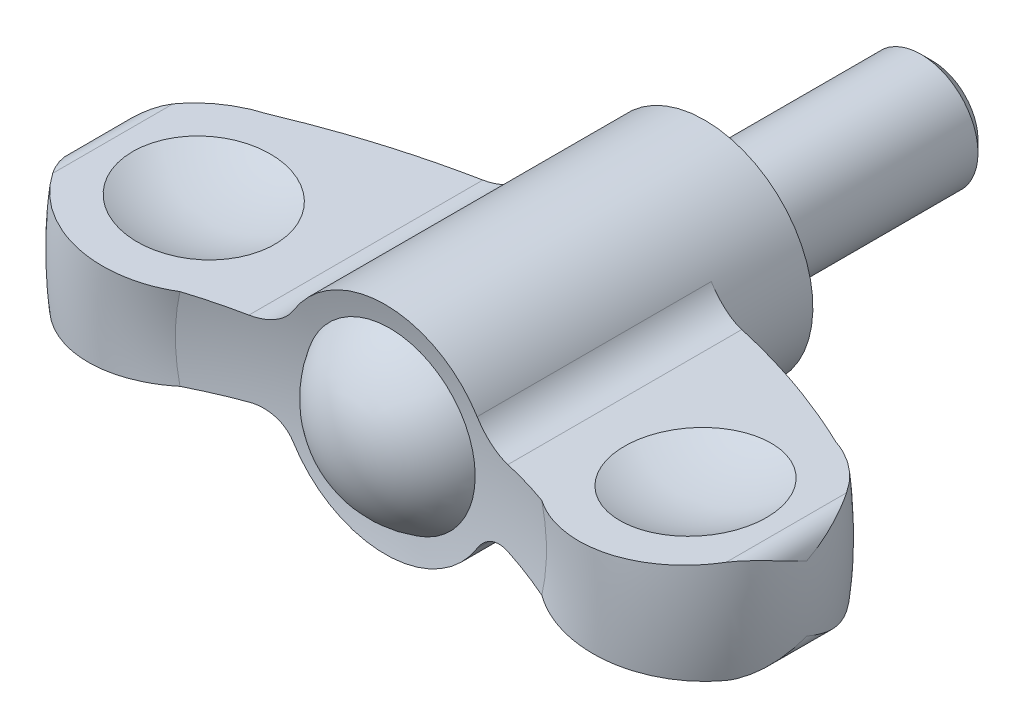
ISO-10303-21;
HEADER;
FILE_DESCRIPTION(('STEP AP214'),'2;1');
FILE_NAME('part.step','',(''),(''),'','','');
FILE_SCHEMA(('AUTOMOTIVE_DESIGN { 1 0 10303 214 1 1 1 1 }'));
ENDSEC;
DATA;
#1=APPLICATION_CONTEXT('core data for automotive mechanical design processes');
#2=APPLICATION_PROTOCOL_DEFINITION('international standard','automotive_design',2000,#1);
#3=PRODUCT_CONTEXT('',#1,'mechanical');
#4=PRODUCT('Part','Part','',(#3));
#5=PRODUCT_RELATED_PRODUCT_CATEGORY('part','',(#4));
#6=PRODUCT_DEFINITION_FORMATION('','',#4);
#7=PRODUCT_DEFINITION_CONTEXT('part definition',#1,'design');
#8=PRODUCT_DEFINITION('design','',#6,#7);
#9=PRODUCT_DEFINITION_SHAPE('','',#8);
#10=(LENGTH_UNIT() NAMED_UNIT(*) SI_UNIT(.MILLI.,.METRE.));
#11=(NAMED_UNIT(*) PLANE_ANGLE_UNIT() SI_UNIT($,.RADIAN.));
#12=(NAMED_UNIT(*) SI_UNIT($,.STERADIAN.) SOLID_ANGLE_UNIT());
#13=UNCERTAINTY_MEASURE_WITH_UNIT(LENGTH_MEASURE(1.E-05),#10,'distance_accuracy_value','');
#14=(GEOMETRIC_REPRESENTATION_CONTEXT(3) GLOBAL_UNCERTAINTY_ASSIGNED_CONTEXT((#13)) GLOBAL_UNIT_ASSIGNED_CONTEXT((#10,
#11,#12)) REPRESENTATION_CONTEXT('',''));
#15=CARTESIAN_POINT('',(0.,0.,0.));
#16=DIRECTION('',(0.,0.,1.));
#17=DIRECTION('',(1.,0.,0.));
#18=AXIS2_PLACEMENT_3D('',#15,#16,#17);
#19=CARTESIAN_POINT('',(0.,0.,76.6132216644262));
#20=DIRECTION('',(0.,0.,1.));
#21=DIRECTION('',(0.,1.,0.));
#22=AXIS2_PLACEMENT_3D('',#19,#20,#21);
#23=DEGENERATE_TOROIDAL_SURFACE('',#22,7.41274216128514,71.1525000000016,.F.);
#24=CARTESIAN_POINT('',(0.,0.,7.5));
#25=DIRECTION('',(0.,0.,1.));
#26=DIRECTION('',(0.,1.,0.));
#27=AXIS2_PLACEMENT_3D('',#24,#25,#26);
#28=CIRCLE('',#27,9.5);
#29=CARTESIAN_POINT('',(8.07537706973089,-5.00382705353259,7.5));
#30=VERTEX_POINT('',#29);
#31=CARTESIAN_POINT('',(8.07537711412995,5.0038269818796,7.5));
#32=VERTEX_POINT('',#31);
#33=EDGE_CURVE('E157',#30,#32,#28,.T.);
#34=ORIENTED_EDGE('',*,*,#33,.T.);
#35=CARTESIAN_POINT('',(8.07525319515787,5.00402698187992,7.50000000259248));
#36=CARTESIAN_POINT('',(8.12665454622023,4.92103773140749,7.49999174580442));
#37=CARTESIAN_POINT('',(8.18144861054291,4.84015820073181,7.50133541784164));
#38=CARTESIAN_POINT('',(8.29736182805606,4.68318005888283,7.50668034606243));
#39=CARTESIAN_POINT('',(8.35847989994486,4.607080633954,7.51068114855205));
#40=CARTESIAN_POINT('',(8.48644181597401,4.46037528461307,7.52128110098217));
#41=CARTESIAN_POINT('',(8.55327127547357,4.38975636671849,7.52787386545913));
#42=CARTESIAN_POINT('',(8.69224302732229,4.25429556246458,7.54356393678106));
#43=CARTESIAN_POINT('',(8.76438537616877,4.18945373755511,7.55266127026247));
#44=CARTESIAN_POINT('',(8.98795756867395,4.00427129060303,7.58354719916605));
#45=CARTESIAN_POINT('',(9.14667405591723,3.89311211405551,7.60894168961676));
#46=CARTESIAN_POINT('',(9.4786404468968,3.69815734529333,7.66816076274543));
#47=CARTESIAN_POINT('',(9.65189888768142,3.61437796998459,7.70199032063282));
#48=CARTESIAN_POINT('',(10.0125625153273,3.47403571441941,7.77763329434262));
#49=CARTESIAN_POINT('',(10.2002114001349,3.41819606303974,7.8196232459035));
#50=CARTESIAN_POINT('',(10.5805892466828,3.33774343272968,7.90948197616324));
#51=CARTESIAN_POINT('',(10.7733131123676,3.31310026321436,7.95734502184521));
#52=CARTESIAN_POINT('',(11.033653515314,3.30081513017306,8.02491673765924));
#53=CARTESIAN_POINT('',(11.1013248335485,3.29954054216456,8.04274730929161));
#54=CARTESIAN_POINT('',(11.236373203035,3.30079631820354,8.07885369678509));
#55=CARTESIAN_POINT('',(11.3037505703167,3.30331932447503,8.09712858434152));
#56=CARTESIAN_POINT('',(11.3709729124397,3.30772213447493,8.11561851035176));
#57=B_SPLINE_CURVE_WITH_KNOTS('',3,(#35,#36,#37,#38,#39,#40,#41,#42,#43,#44,#45,#46,#47,#48,#49,
#50,#51,#52,#53,#54,#55,#56),.UNSPECIFIED.,.F.,.F.,(4,2,2,2,2,2,2,2,2,2,4),(0.,
0.292752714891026,0.585455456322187,0.87744157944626,1.16943080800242,1.75277206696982,
2.33645821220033,2.93455895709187,3.53208044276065,3.74198071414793,3.95147483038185),.UNSPECIFIED.);
#58=CARTESIAN_POINT('',(11.3707729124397,3.30770903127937,8.11556349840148));
#59=VERTEX_POINT('',#58);
#60=EDGE_CURVE('E251',#32,#59,#57,.T.);
#61=ORIENTED_EDGE('',*,*,#60,.T.);
#62=CARTESIAN_POINT('',(24.9191403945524,4.19496480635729,13.4109144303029));
#63=CARTESIAN_POINT('',(23.8381391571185,4.12417217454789,12.8535823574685));
#64=CARTESIAN_POINT('',(22.7428134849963,4.05244146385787,12.324205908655));
#65=CARTESIAN_POINT('',(20.5293345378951,3.90748510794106,11.3241128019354));
#66=CARTESIAN_POINT('',(19.4112500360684,3.83426396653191,10.8532432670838));
#67=CARTESIAN_POINT('',(17.1522467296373,3.68632631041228,9.96991193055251));
#68=CARTESIAN_POINT('',(16.0113274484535,3.61160976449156,9.55745134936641));
#69=CARTESIAN_POINT('',(14.2836536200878,3.49846782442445,8.98318373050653));
#70=CARTESIAN_POINT('',(13.7042390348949,3.46052310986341,8.79894257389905));
#71=CARTESIAN_POINT('',(12.5407906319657,3.38433117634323,8.44572577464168));
#72=CARTESIAN_POINT('',(11.956756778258,3.34608395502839,8.27675025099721));
#73=CARTESIAN_POINT('',(11.3705729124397,3.30769593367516,8.11550848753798));
#74=B_SPLINE_CURVE_WITH_KNOTS('',3,(#62,#63,#64,#65,#66,#67,#68,#69,#70,#71,#72,#73),
.UNSPECIFIED.,.F.,.F.,(4,2,2,2,2,4),(0.,3.65437061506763,7.29898215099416,10.9436698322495,
12.771042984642,14.5984303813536),.UNSPECIFIED.);
#75=CARTESIAN_POINT('',(24.9187524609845,4.19493940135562,13.4107144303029));
#76=VERTEX_POINT('',#75);
#77=EDGE_CURVE('E242',#76,#59,#74,.T.);
#78=ORIENTED_EDGE('',*,*,#77,.F.);
#79=CARTESIAN_POINT('',(0.,0.,13.4107144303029));
#80=DIRECTION('',(0.,0.,1.));
#81=DIRECTION('',(0.,1.,0.));
#82=AXIS2_PLACEMENT_3D('',#79,#80,#81);
#83=CIRCLE('',#82,25.2693834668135);
#84=CARTESIAN_POINT('',(24.9187524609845,-4.19493940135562,13.4107144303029));
#85=VERTEX_POINT('',#84);
#86=EDGE_CURVE('E402',#85,#76,#83,.T.);
#87=ORIENTED_EDGE('',*,*,#86,.F.);
#88=CARTESIAN_POINT('',(11.3705729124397,-3.30769593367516,8.11550848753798));
#89=CARTESIAN_POINT('',(13.3194357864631,-3.43532310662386,8.65165350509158));
#90=CARTESIAN_POINT('',(15.2454387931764,-3.56145323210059,9.27335320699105));
#91=CARTESIAN_POINT('',(19.0285581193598,-3.80920223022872,10.6774595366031));
#92=CARTESIAN_POINT('',(20.8859409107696,-3.93083855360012,11.4591449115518));
#93=CARTESIAN_POINT('',(23.0778618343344,-4.07438311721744,12.4939591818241));
#94=CARTESIAN_POINT('',(23.4481408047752,-4.09863195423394,12.6727423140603));
#95=CARTESIAN_POINT('',(24.1858660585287,-4.14694412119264,13.0369148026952));
#96=CARTESIAN_POINT('',(24.5533094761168,-4.1710072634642,13.2223099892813));
#97=CARTESIAN_POINT('',(24.9191403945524,-4.19496480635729,13.4109144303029));
#98=B_SPLINE_CURVE_WITH_KNOTS('',3,(#88,#89,#90,#91,#92,#93,#94,#95,#96,#97),.UNSPECIFIED.,.F.,
.F.,(4,2,2,2,4),(0.,6.07517314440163,12.1235385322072,13.3591937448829,14.5959668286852),.UNSPECIFIED.);
#99=CARTESIAN_POINT('',(11.3707729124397,-3.30770903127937,8.11556349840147));
#100=VERTEX_POINT('',#99);
#101=EDGE_CURVE('E232',#100,#85,#98,.T.);
#102=ORIENTED_EDGE('',*,*,#101,.F.);
#103=CARTESIAN_POINT('',(11.3709729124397,-3.30772213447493,8.11561851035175));
#104=CARTESIAN_POINT('',(11.2701325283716,-3.30110509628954,8.08788118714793));
#105=CARTESIAN_POINT('',(11.1688817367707,-3.29874082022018,8.06061250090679));
#106=CARTESIAN_POINT('',(10.9662236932,-3.3025707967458,8.00721735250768));
#107=CARTESIAN_POINT('',(10.86481641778,-3.30876648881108,7.98109108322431));
#108=CARTESIAN_POINT('',(10.6624409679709,-3.32978238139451,7.93016922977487));
#109=CARTESIAN_POINT('',(10.5614733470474,-3.34461137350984,7.90537503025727));
#110=CARTESIAN_POINT('',(10.3608328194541,-3.38287019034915,7.85737208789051));
#111=CARTESIAN_POINT('',(10.2611598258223,-3.40629943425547,7.83416323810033));
#112=CARTESIAN_POINT('',(9.96486870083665,-3.48949811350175,7.76717843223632));
#113=CARTESIAN_POINT('',(9.77109378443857,-3.56216663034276,7.72607333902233));
#114=CARTESIAN_POINT('',(9.39755022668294,-3.74054378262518,7.65286990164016));
#115=CARTESIAN_POINT('',(9.21777675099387,-3.84624095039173,7.62076843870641));
#116=CARTESIAN_POINT('',(8.96611052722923,-4.02532517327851,7.58103605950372));
#117=CARTESIAN_POINT('',(8.88646307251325,-4.08719630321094,7.56933067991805));
#118=CARTESIAN_POINT('',(8.73245596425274,-4.21758210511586,7.54853793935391));
#119=CARTESIAN_POINT('',(8.65809406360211,-4.28609392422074,7.53944946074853));
#120=CARTESIAN_POINT('',(8.51538277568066,-4.42916784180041,7.52402786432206));
#121=CARTESIAN_POINT('',(8.44702397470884,-4.50372010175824,7.51769036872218));
#122=CARTESIAN_POINT('',(8.31677244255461,-4.65839173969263,7.50784180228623));
#123=CARTESIAN_POINT('',(8.25487550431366,-4.73850743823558,7.50432888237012));
#124=CARTESIAN_POINT('',(8.1753277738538,-4.85096452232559,7.50150027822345));
#125=CARTESIAN_POINT('',(8.15464683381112,-4.88116885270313,7.50093670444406));
#126=CARTESIAN_POINT('',(8.11423881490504,-4.94215928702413,7.50018643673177));
#127=CARTESIAN_POINT('',(8.09451057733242,-4.97294461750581,7.49999927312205));
#128=CARTESIAN_POINT('',(8.07525315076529,-5.00402705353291,7.50000000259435));
#129=B_SPLINE_CURVE_WITH_KNOTS('',3,(#103,#104,#105,#106,#107,#108,#109,#110,#111,#112,#113,
#114,#115,#116,#117,#118,#119,#120,#121,#122,#123,#124,#125,#126,#127,#128),.UNSPECIFIED.,.F.,
.F.,(4,2,2,2,2,2,2,2,2,2,2,2,4),(0.,0.314298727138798,0.628650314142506,0.943322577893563,
1.25797359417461,1.88762970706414,2.51706744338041,2.82134305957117,3.12548853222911,
3.42914821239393,3.73260894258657,3.8424257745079,3.95210549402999),.UNSPECIFIED.);
#130=EDGE_CURVE('E222',#100,#30,#129,.T.);
#131=ORIENTED_EDGE('',*,*,#130,.T.);
#132=EDGE_LOOP('',(#34,#61,#78,#87,#102,#131));
#133=FACE_BOUND('',#132,.T.);
#134=ADVANCED_FACE('F14',(#133),#23,.F.);
#135=CARTESIAN_POINT('',(0.,0.,22.4));
#136=DIRECTION('',(0.,0.,1.));
#137=DIRECTION('',(0.,1.,0.));
#138=AXIS2_PLACEMENT_3D('',#135,#136,#137);
#139=TOROIDAL_SURFACE('',#138,21.9,9.6);
#140=CARTESIAN_POINT('',(-18.1474454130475,-3.75149990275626,13.4105144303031));
#141=CARTESIAN_POINT('',(-17.8905850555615,-3.73467862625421,13.5060281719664));
#142=CARTESIAN_POINT('',(-17.6377608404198,-3.71812166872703,13.6124268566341));
#143=CARTESIAN_POINT('',(-17.1419285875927,-3.68565059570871,13.8461211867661));
#144=CARTESIAN_POINT('',(-16.8989202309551,-3.66973645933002,13.9734161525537));
#145=CARTESIAN_POINT('',(-16.4245099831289,-3.63866827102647,14.2479997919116));
#146=CARTESIAN_POINT('',(-16.1931050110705,-3.62351401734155,14.3952831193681));
#147=CARTESIAN_POINT('',(-15.743480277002,-3.59406898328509,14.7088327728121));
#148=CARTESIAN_POINT('',(-15.5252603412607,-3.57977819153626,14.8750988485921));
#149=CARTESIAN_POINT('',(-15.1034606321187,-3.55215536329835,15.2255617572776));
#150=CARTESIAN_POINT('',(-14.8998888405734,-3.53882384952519,15.4097682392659));
#151=CARTESIAN_POINT('',(-14.5090032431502,-3.51322552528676,15.794766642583));
#152=CARTESIAN_POINT('',(-14.321689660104,-3.50095872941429,15.9955587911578));
#153=CARTESIAN_POINT('',(-13.9647725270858,-3.4775849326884,16.4122828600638));
#154=CARTESIAN_POINT('',(-13.7951642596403,-3.46647762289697,16.6282107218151));
#155=CARTESIAN_POINT('',(-13.4749045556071,-3.44550444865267,17.073751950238));
#156=CARTESIAN_POINT('',(-13.3242529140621,-3.43563857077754,17.3033651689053));
#157=CARTESIAN_POINT('',(-13.0439598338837,-3.41728273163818,17.7732237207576));
#158=CARTESIAN_POINT('',(-12.9141954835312,-3.40878472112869,18.0133954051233));
#159=CARTESIAN_POINT('',(-12.6756273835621,-3.39316136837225,18.5039680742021));
#160=CARTESIAN_POINT('',(-12.5668227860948,-3.38603597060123,18.7543686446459));
#161=CARTESIAN_POINT('',(-12.3710778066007,-3.37321701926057,19.2636307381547));
#162=CARTESIAN_POINT('',(-12.2841387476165,-3.36752355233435,19.5224927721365));
#163=CARTESIAN_POINT('',(-12.1328924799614,-3.35761873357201,20.0467739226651));
#164=CARTESIAN_POINT('',(-12.0685848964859,-3.35340735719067,20.3121929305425));
#165=CARTESIAN_POINT('',(-11.9641647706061,-3.34656908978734,20.842606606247));
#166=CARTESIAN_POINT('',(-11.9236219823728,-3.34391402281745,21.1075162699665));
#167=CARTESIAN_POINT('',(-11.8652424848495,-3.34009086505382,21.6398358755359));
#168=CARTESIAN_POINT('',(-11.8474054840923,-3.33892275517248,21.9072457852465));
#169=CARTESIAN_POINT('',(-11.8345982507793,-3.33808403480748,22.4425774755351));
#170=CARTESIAN_POINT('',(-11.8396248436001,-3.33841321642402,22.7104991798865));
#171=CARTESIAN_POINT('',(-11.8724923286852,-3.34056564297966,23.2449323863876));
#172=CARTESIAN_POINT('',(-11.9003331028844,-3.34238888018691,23.5114438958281));
#173=CARTESIAN_POINT('',(-11.9780680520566,-3.34747958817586,24.0376567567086));
#174=CARTESIAN_POINT('',(-12.027669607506,-3.35072789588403,24.2974015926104));
#175=CARTESIAN_POINT('',(-12.1484267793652,-3.35863604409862,24.811805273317));
#176=CARTESIAN_POINT('',(-12.2195821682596,-3.36329586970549,25.0664641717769));
#177=CARTESIAN_POINT('',(-12.3828443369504,-3.37398758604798,25.5689078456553));
#178=CARTESIAN_POINT('',(-12.4749485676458,-3.38001930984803,25.8166934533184));
#179=CARTESIAN_POINT('',(-12.679407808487,-3.39340894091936,26.3038316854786));
#180=CARTESIAN_POINT('',(-12.7917703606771,-3.40076734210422,26.543181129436));
#181=CARTESIAN_POINT('',(-13.0369078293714,-3.41682090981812,27.0137884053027));
#182=CARTESIAN_POINT('',(-13.1698514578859,-3.42552712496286,27.2449579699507));
#183=CARTESIAN_POINT('',(-13.4544154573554,-3.44416265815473,27.6954567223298));
#184=CARTESIAN_POINT('',(-13.6060365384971,-3.45409202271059,27.9147854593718));
#185=CARTESIAN_POINT('',(-13.9268367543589,-3.47510059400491,28.3401572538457));
#186=CARTESIAN_POINT('',(-14.0960166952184,-3.48617985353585,28.5461997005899));
#187=CARTESIAN_POINT('',(-14.4507138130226,-3.50940826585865,28.9436423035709));
#188=CARTESIAN_POINT('',(-14.6362312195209,-3.52155743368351,29.1350422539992));
#189=CARTESIAN_POINT('',(-15.0260268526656,-3.54708437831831,29.5054914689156));
#190=CARTESIAN_POINT('',(-15.2305978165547,-3.56048132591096,29.6842314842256));
#191=CARTESIAN_POINT('',(-15.6538967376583,-3.58820233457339,30.0239900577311));
#192=CARTESIAN_POINT('',(-15.8726245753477,-3.6025263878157,30.1850087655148));
#193=CARTESIAN_POINT('',(-16.322752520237,-3.63200437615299,30.4882695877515));
#194=CARTESIAN_POINT('',(-16.5541555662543,-3.6471585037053,30.6305073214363));
#195=CARTESIAN_POINT('',(-17.0278914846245,-3.67818253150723,30.8951425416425));
#196=CARTESIAN_POINT('',(-17.2702206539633,-3.69405218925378,31.017546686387));
#197=CARTESIAN_POINT('',(-17.7669669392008,-3.72658312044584,31.2429802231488));
#198=CARTESIAN_POINT('',(-18.0214889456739,-3.74325126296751,31.3457775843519));
#199=CARTESIAN_POINT('',(-18.538265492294,-3.77709393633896,31.5295393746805));
#200=CARTESIAN_POINT('',(-18.8005200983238,-3.79426847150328,31.6105036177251));
#201=CARTESIAN_POINT('',(-19.3309113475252,-3.82900274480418,31.7500060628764));
#202=CARTESIAN_POINT('',(-19.5990481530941,-3.84656249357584,31.8085436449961));
#203=CARTESIAN_POINT('',(-20.1392890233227,-3.88194179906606,31.9027453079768));
#204=CARTESIAN_POINT('',(-20.4113930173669,-3.89976135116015,31.9384097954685));
#205=CARTESIAN_POINT('',(-20.9576381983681,-3.93553386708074,31.9865808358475));
#206=CARTESIAN_POINT('',(-21.2317794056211,-3.95348683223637,31.9990871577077));
#207=CARTESIAN_POINT('',(-21.7801364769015,-3.98939765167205,32.0008164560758));
#208=CARTESIAN_POINT('',(-22.0543523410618,-4.00735550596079,31.9900393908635));
#209=CARTESIAN_POINT('',(-22.6008596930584,-4.04314519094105,31.9452447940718));
#210=CARTESIAN_POINT('',(-22.8731513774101,-4.06097703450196,31.9112296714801));
#211=CARTESIAN_POINT('',(-23.4138724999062,-4.09638779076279,31.8201695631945));
#212=CARTESIAN_POINT('',(-23.6823019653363,-4.1139667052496,31.7631247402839));
#213=CARTESIAN_POINT('',(-24.2118784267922,-4.14864761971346,31.6267614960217));
#214=CARTESIAN_POINT('',(-24.4730575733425,-4.16575172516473,31.547568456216));
#215=CARTESIAN_POINT('',(-24.987795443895,-4.19946088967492,31.3673123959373));
#216=CARTESIAN_POINT('',(-25.2413540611,-4.2160659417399,31.2662490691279));
#217=CARTESIAN_POINT('',(-25.7391278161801,-4.24866415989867,31.0428965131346));
#218=CARTESIAN_POINT('',(-25.9833385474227,-4.26465703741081,30.9205974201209));
#219=CARTESIAN_POINT('',(-26.4605066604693,-4.29590583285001,30.655664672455));
#220=CARTESIAN_POINT('',(-26.6934645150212,-4.31116178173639,30.5130318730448));
#221=CARTESIAN_POINT('',(-27.1452633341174,-4.34074919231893,30.2092249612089));
#222=CARTESIAN_POINT('',(-27.3641711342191,-4.35508503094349,30.0481506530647));
#223=CARTESIAN_POINT('',(-27.7875859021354,-4.38281362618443,29.7080080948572));
#224=CARTESIAN_POINT('',(-27.9920934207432,-4.39620641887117,29.5289405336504));
#225=CARTESIAN_POINT('',(-28.3848624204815,-4.42192808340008,29.1544313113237));
#226=CARTESIAN_POINT('',(-28.5731528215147,-4.43425884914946,28.9590200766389));
#227=CARTESIAN_POINT('',(-28.9324617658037,-4.45778928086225,28.5530043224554));
#228=CARTESIAN_POINT('',(-29.1034908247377,-4.4689896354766,28.3424091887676));
#229=CARTESIAN_POINT('',(-29.319374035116,-4.48312739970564,28.0522910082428));
#230=CARTESIAN_POINT('',(-29.3724491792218,-4.48660318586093,27.9788119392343));
#231=CARTESIAN_POINT('',(-29.4764415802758,-4.49341344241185,27.8304567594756));
#232=CARTESIAN_POINT('',(-29.5273611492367,-4.49674806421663,27.7555822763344));
#233=CARTESIAN_POINT('',(-29.5772181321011,-4.50001309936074,27.679991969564));
#234=B_SPLINE_CURVE_WITH_KNOTS('',3,(#140,#141,#142,#143,#144,#145,#146,#147,#148,#149,#150,
#151,#152,#153,#154,#155,#156,#157,#158,#159,#160,#161,#162,#163,#164,#165,#166,#167,#168,#169,
#170,#171,#172,#173,#174,#175,#176,#177,#178,#179,#180,#181,#182,#183,#184,#185,#186,#187,#188,
#189,#190,#191,#192,#193,#194,#195,#196,#197,#198,#199,#200,#201,#202,#203,#204,#205,#206,#207,
#208,#209,#210,#211,#212,#213,#214,#215,#216,#217,#218,#219,#220,#221,#222,#223,#224,#225,#226,
#227,#228,#229,#230,#231,#232,#233),.UNSPECIFIED.,.F.,.F.,(4,2,2,2,2,2,2,2,2,2,2,2,2,2,2,2,2,2,
2,2,2,2,2,2,2,2,2,2,2,2,2,2,2,2,2,2,2,2,2,2,2,2,2,2,2,2,4),(0.,0.82342903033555,
1.64683128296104,2.47001373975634,3.29318534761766,4.11680216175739,4.9404302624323,
5.76383834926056,6.58723753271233,7.40559872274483,8.22392680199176,9.04230438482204,
9.86066841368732,10.6637182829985,11.4667578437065,12.2696859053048,13.0726098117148,
13.8650526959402,14.6574872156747,15.449825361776,16.2424591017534,17.0419728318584,
17.8415169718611,18.6410978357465,19.4406899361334,20.2556974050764,21.0706979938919,
21.8858883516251,22.7008044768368,23.5248358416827,24.3488742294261,25.1729353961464,
25.9969819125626,26.8210366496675,27.6450928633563,28.469063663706,29.2930286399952,
30.1124203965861,30.9318236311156,31.7516084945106,32.5713588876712,33.3868657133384,
34.2023413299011,35.0163312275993,35.8298222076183,36.1019244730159,36.3737270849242),.UNSPECIFIED.);
#235=CARTESIAN_POINT('',(-15.8916566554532,-3.60377276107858,30.1939503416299));
#236=VERTEX_POINT('',#235);
#237=CARTESIAN_POINT('',(-29.5770181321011,-4.5,27.6802951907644));
#238=VERTEX_POINT('',#237);
#239=EDGE_CURVE('E276',#236,#238,#234,.T.);
#240=ORIENTED_EDGE('',*,*,#239,.F.);
#241=CARTESIAN_POINT('',(0.,0.,30.1939503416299));
#242=DIRECTION('',(0.,0.,1.));
#243=DIRECTION('',(0.,1.,0.));
#244=AXIS2_PLACEMENT_3D('',#241,#242,#243);
#245=CIRCLE('',#244,16.2951504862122);
#246=CARTESIAN_POINT('',(-15.8916566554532,3.60377276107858,30.1939503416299));
#247=VERTEX_POINT('',#246);
#248=EDGE_CURVE('E210',#247,#236,#245,.T.);
#249=ORIENTED_EDGE('',*,*,#248,.F.);
#250=CARTESIAN_POINT('',(-29.577218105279,4.50001309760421,27.6799920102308));
#251=CARTESIAN_POINT('',(-29.4283813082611,4.49026607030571,27.9057071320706));
#252=CARTESIAN_POINT('',(-29.2699701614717,4.47989203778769,28.1250732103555));
#253=CARTESIAN_POINT('',(-28.9352574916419,4.45797236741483,28.5496181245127));
#254=CARTESIAN_POINT('',(-28.7589571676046,4.44642680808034,28.7547979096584));
#255=CARTESIAN_POINT('',(-28.3898682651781,4.42225590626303,29.1493363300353));
#256=CARTESIAN_POINT('',(-28.1970944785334,4.40963153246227,29.3387088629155));
#257=CARTESIAN_POINT('',(-27.7963194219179,4.38338556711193,29.7005094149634));
#258=CARTESIAN_POINT('',(-27.5883182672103,4.3697639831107,29.872937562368));
#259=CARTESIAN_POINT('',(-27.1584989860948,4.34161596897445,30.199703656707));
#260=CARTESIAN_POINT('',(-26.9366758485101,4.32708921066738,30.3540349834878));
#261=CARTESIAN_POINT('',(-26.4808650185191,4.29723906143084,30.6434656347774));
#262=CARTESIAN_POINT('',(-26.2468771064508,4.28191565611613,30.7785646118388));
#263=CARTESIAN_POINT('',(-25.7684462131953,4.25058416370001,31.0285776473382));
#264=CARTESIAN_POINT('',(-25.5240048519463,4.23457618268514,31.1434948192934));
#265=CARTESIAN_POINT('',(-25.0263706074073,4.20198710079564,31.3523874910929));
#266=CARTESIAN_POINT('',(-24.773177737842,4.1854060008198,31.4463630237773));
#267=CARTESIAN_POINT('',(-24.2590478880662,4.15173665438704,31.6129966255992));
#268=CARTESIAN_POINT('',(-23.9980896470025,4.13464701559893,31.685588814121));
#269=CARTESIAN_POINT('',(-23.4709078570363,4.10012292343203,31.8086173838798));
#270=CARTESIAN_POINT('',(-23.2046821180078,4.08268832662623,31.8590443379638));
#271=CARTESIAN_POINT('',(-22.6689091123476,4.04760161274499,31.9373839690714));
#272=CARTESIAN_POINT('',(-22.3993613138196,4.0299494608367,31.9652929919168));
#273=CARTESIAN_POINT('',(-21.8589964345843,3.99456203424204,31.9984159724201));
#274=CARTESIAN_POINT('',(-21.5881799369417,3.97682679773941,32.0036394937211));
#275=CARTESIAN_POINT('',(-21.0454404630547,3.94128386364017,31.9913795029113));
#276=CARTESIAN_POINT('',(-20.7735205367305,3.9234763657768,31.9737602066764));
#277=CARTESIAN_POINT('',(-20.2321124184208,3.88802061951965,31.9157373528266));
#278=CARTESIAN_POINT('',(-19.9626242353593,3.8703723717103,31.8753337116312));
#279=CARTESIAN_POINT('',(-19.4280257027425,3.83536257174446,31.7720671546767));
#280=CARTESIAN_POINT('',(-19.1629144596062,3.81800096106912,31.7092088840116));
#281=CARTESIAN_POINT('',(-18.6387730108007,3.78367597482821,31.5614710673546));
#282=CARTESIAN_POINT('',(-18.3797450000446,3.76671274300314,31.4765837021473));
#283=CARTESIAN_POINT('',(-17.8682212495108,3.73321406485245,31.2848646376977));
#284=CARTESIAN_POINT('',(-17.6157711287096,3.71668160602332,31.177910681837));
#285=CARTESIAN_POINT('',(-17.1207307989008,3.6842623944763,30.9431230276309));
#286=CARTESIAN_POINT('',(-16.8781406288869,3.66837564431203,30.8152892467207));
#287=CARTESIAN_POINT('',(-16.4045275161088,3.63735965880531,30.5396362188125));
#288=CARTESIAN_POINT('',(-16.1735051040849,3.62223045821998,30.3918160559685));
#289=CARTESIAN_POINT('',(-15.7246794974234,3.59283775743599,30.0772205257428));
#290=CARTESIAN_POINT('',(-15.5068766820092,3.57857428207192,29.9104446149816));
#291=CARTESIAN_POINT('',(-15.0856203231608,3.55098703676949,29.5587225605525));
#292=CARTESIAN_POINT('',(-14.8821981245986,3.53766531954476,29.3737387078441));
#293=CARTESIAN_POINT('',(-14.4917116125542,3.51209313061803,28.9871837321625));
#294=CARTESIAN_POINT('',(-14.3046468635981,3.49984263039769,28.7856130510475));
#295=CARTESIAN_POINT('',(-13.9482722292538,3.47650436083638,28.3672761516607));
#296=CARTESIAN_POINT('',(-13.7789624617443,3.46541659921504,28.1505098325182));
#297=CARTESIAN_POINT('',(-13.4594078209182,3.4444895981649,27.7032976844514));
#298=CARTESIAN_POINT('',(-13.3091625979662,3.43465033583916,27.4728521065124));
#299=CARTESIAN_POINT('',(-13.0300075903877,3.4163690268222,27.0017206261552));
#300=CARTESIAN_POINT('',(-12.9009427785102,3.40791682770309,26.7611269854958));
#301=CARTESIAN_POINT('',(-12.6638563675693,3.39239050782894,26.269856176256));
#302=CARTESIAN_POINT('',(-12.5558264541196,3.38531584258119,26.0191830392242));
#303=CARTESIAN_POINT('',(-12.3616487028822,3.37259952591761,25.5094385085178));
#304=CARTESIAN_POINT('',(-12.2755026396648,3.36695799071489,25.2503664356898));
#305=CARTESIAN_POINT('',(-12.125856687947,3.35715797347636,24.7257346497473));
#306=CARTESIAN_POINT('',(-12.0623564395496,3.35299946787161,24.4601750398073));
#307=CARTESIAN_POINT('',(-11.9595441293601,3.34626649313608,23.9295575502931));
#308=CARTESIAN_POINT('',(-11.9198013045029,3.34366381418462,23.6645834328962));
#309=CARTESIAN_POINT('',(-11.8630211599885,3.33994539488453,23.1322038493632));
#310=CARTESIAN_POINT('',(-11.8459835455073,3.33882963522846,22.8647984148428));
#311=CARTESIAN_POINT('',(-11.8347668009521,3.33809507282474,22.3295252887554));
#312=CARTESIAN_POINT('',(-11.8405860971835,3.33847616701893,22.0616576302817));
#313=CARTESIAN_POINT('',(-11.8750272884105,3.34073165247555,21.5273997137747));
#314=CARTESIAN_POINT('',(-11.9036490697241,3.34260603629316,21.2610094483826));
#315=CARTESIAN_POINT('',(-11.9829240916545,3.34779760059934,20.7350583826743));
#316=CARTESIAN_POINT('',(-12.033288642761,3.35109587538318,20.4754538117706));
#317=CARTESIAN_POINT('',(-12.1555550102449,3.35910285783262,19.961393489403));
#318=CARTESIAN_POINT('',(-12.2274566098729,3.36381155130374,19.7069376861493));
#319=CARTESIAN_POINT('',(-12.3921774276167,3.37459879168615,19.2049950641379));
#320=CARTESIAN_POINT('',(-12.4849912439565,3.38067698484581,18.9575064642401));
#321=CARTESIAN_POINT('',(-12.6908448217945,3.39415792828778,18.470999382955));
#322=CARTESIAN_POINT('',(-12.8038936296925,3.40156127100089,18.2319847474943));
#323=CARTESIAN_POINT('',(-13.050399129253,3.41770442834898,17.7620583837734));
#324=CARTESIAN_POINT('',(-13.1840279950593,3.42645551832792,17.5312373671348));
#325=CARTESIAN_POINT('',(-13.4698675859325,3.4451745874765,17.0815911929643));
#326=CARTESIAN_POINT('',(-13.6220707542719,3.45514207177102,16.8627612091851));
#327=CARTESIAN_POINT('',(-13.9440945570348,3.4762307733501,16.4382825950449));
#328=CARTESIAN_POINT('',(-14.113927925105,3.48735282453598,16.2326436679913));
#329=CARTESIAN_POINT('',(-14.4698944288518,3.51066436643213,15.836072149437));
#330=CARTESIAN_POINT('',(-14.6560271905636,3.52285383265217,15.6451392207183));
#331=CARTESIAN_POINT('',(-15.0471805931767,3.54846969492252,15.2755429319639));
#332=CARTESIAN_POINT('',(-15.2525053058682,3.56191600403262,15.097202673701));
#333=CARTESIAN_POINT('',(-15.6772923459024,3.58973446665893,14.7583242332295));
#334=CARTESIAN_POINT('',(-15.8967545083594,3.60410660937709,14.5977858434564));
#335=CARTESIAN_POINT('',(-16.3478939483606,3.63365083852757,14.2958496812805));
#336=CARTESIAN_POINT('',(-16.5795509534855,3.64882159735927,14.1544214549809));
#337=CARTESIAN_POINT('',(-17.0537037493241,3.67987292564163,13.8914238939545));
#338=CARTESIAN_POINT('',(-17.2961933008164,3.69575308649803,13.769843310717));
#339=CARTESIAN_POINT('',(-17.6425873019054,3.71843774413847,13.6138611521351));
#340=CARTESIAN_POINT('',(-17.7426773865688,3.7249924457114,13.5707938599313));
#341=CARTESIAN_POINT('',(-17.9441132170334,3.7381840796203,13.4880908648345));
#342=CARTESIAN_POINT('',(-18.045457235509,3.74482089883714,13.4484509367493));
#343=CARTESIAN_POINT('',(-18.1474454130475,3.75149990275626,13.4105144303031));
#344=B_SPLINE_CURVE_WITH_KNOTS('',3,(#250,#251,#252,#253,#254,#255,#256,#257,#258,#259,#260,
#261,#262,#263,#264,#265,#266,#267,#268,#269,#270,#271,#272,#273,#274,#275,#276,#277,#278,#279,
#280,#281,#282,#283,#284,#285,#286,#287,#288,#289,#290,#291,#292,#293,#294,#295,#296,#297,#298,
#299,#300,#301,#302,#303,#304,#305,#306,#307,#308,#309,#310,#311,#312,#313,#314,#315,#316,#317,
#318,#319,#320,#321,#322,#323,#324,#325,#326,#327,#328,#329,#330,#331,#332,#333,#334,#335,#336,
#337,#338,#339,#340,#341,#342,#343),.UNSPECIFIED.,.F.,.F.,(4,2,2,2,2,2,2,2,2,2,2,2,2,2,2,2,2,2,
2,2,2,2,2,2,2,2,2,2,2,2,2,2,2,2,2,2,2,2,2,2,2,2,2,2,2,2,4),(0.,0.811383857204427,
1.62271336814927,2.43332187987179,3.24392425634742,4.05482224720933,4.86573488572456,
5.67652231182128,6.48730846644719,7.30056707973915,8.11417124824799,8.92790742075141,
9.7413005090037,10.5595508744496,11.3778042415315,12.1958884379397,13.0142634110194,
13.8373004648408,14.6603407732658,15.4834188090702,16.3065204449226,17.1313641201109,
17.9561858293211,18.7810130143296,19.6058250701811,20.4243011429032,21.2424530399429,
22.0606712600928,22.8788764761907,23.6817568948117,24.4846268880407,25.2874416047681,
26.0902523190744,26.8827166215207,27.6751729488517,28.4674248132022,29.2600317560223,
30.0596712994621,30.8589865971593,31.658883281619,32.4587616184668,33.2746912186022,
34.090611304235,34.9052154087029,35.7193562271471,36.0467859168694,36.3738060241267),.UNSPECIFIED.);
#345=CARTESIAN_POINT('',(-29.577018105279,4.5,27.6802952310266));
#346=VERTEX_POINT('',#345);
#347=EDGE_CURVE('E298',#346,#247,#344,.T.);
#348=ORIENTED_EDGE('',*,*,#347,.F.);
#349=CARTESIAN_POINT('',(-31.369564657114,2.86363636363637,22.4));
#350=CARTESIAN_POINT('',(-31.3693228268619,2.86628559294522,22.4059654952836));
#351=CARTESIAN_POINT('',(-31.3690751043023,2.86893438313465,22.4119311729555));
#352=CARTESIAN_POINT('',(-31.3455550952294,3.11453943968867,22.9652019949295));
#353=CARTESIAN_POINT('',(-31.2727100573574,3.35362322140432,23.5139845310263));
#354=CARTESIAN_POINT('',(-31.0906514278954,3.68216340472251,24.3317563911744));
#355=CARTESIAN_POINT('',(-31.0177760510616,3.78670945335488,24.6035877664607));
#356=CARTESIAN_POINT('',(-30.8477677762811,3.98135441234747,25.1449637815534));
#357=CARTESIAN_POINT('',(-30.7506472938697,4.07146067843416,25.4145095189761));
#358=CARTESIAN_POINT('',(-30.5719332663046,4.20252900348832,25.8529322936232));
#359=CARTESIAN_POINT('',(-30.4974342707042,4.24947683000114,26.0229493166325));
#360=CARTESIAN_POINT('',(-30.3388744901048,4.33328283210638,26.3608778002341));
#361=CARTESIAN_POINT('',(-30.2548212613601,4.37014890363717,26.5287908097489));
#362=CARTESIAN_POINT('',(-30.0769796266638,4.43174329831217,26.8627513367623));
#363=CARTESIAN_POINT('',(-29.9831491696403,4.45641633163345,27.0287870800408));
#364=CARTESIAN_POINT('',(-29.8357178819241,4.48201227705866,27.2752518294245));
#365=CARTESIAN_POINT('',(-29.7853951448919,4.48864307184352,27.3570723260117));
#366=CARTESIAN_POINT('',(-29.6826484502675,4.4976362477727,27.5196657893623));
#367=CARTESIAN_POINT('',(-29.630223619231,4.49999683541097,27.6004383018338));
#368=CARTESIAN_POINT('',(-29.5768181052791,4.4999999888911,27.6805954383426));
#369=B_SPLINE_CURVE_WITH_KNOTS('',3,(#349,#350,#351,#352,#353,#354,#355,#356,#357,#358,#359,
#360,#361,#362,#363,#364,#365,#366,#367,#368),.UNSPECIFIED.,.F.,.F.,(4,2,2,2,2,2,2,2,2,4),(0.,
0.0195959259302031,1.81731826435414,2.71712331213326,3.61646852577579,4.19044381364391,
4.76396827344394,5.34007007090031,5.62881792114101,5.91768701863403),.UNSPECIFIED.);
#370=CARTESIAN_POINT('',(-31.369564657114,2.86363636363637,22.4));
#371=VERTEX_POINT('',#370);
#372=EDGE_CURVE('E360',#371,#346,#369,.T.);
#373=ORIENTED_EDGE('',*,*,#372,.F.);
#374=CARTESIAN_POINT('',(-29.576818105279,4.49999998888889,17.1194045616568));
#375=CARTESIAN_POINT('',(-29.619139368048,4.50000102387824,17.1829266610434));
#376=CARTESIAN_POINT('',(-29.6608485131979,4.49851722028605,17.2468391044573));
#377=CARTESIAN_POINT('',(-29.7429683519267,4.49280699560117,17.3753522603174));
#378=CARTESIAN_POINT('',(-29.7833793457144,4.48858121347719,17.4399528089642));
#379=CARTESIAN_POINT('',(-29.9024609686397,4.47214705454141,17.6344933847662));
#380=CARTESIAN_POINT('',(-29.9791105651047,4.45618046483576,17.765367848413));
#381=CARTESIAN_POINT('',(-30.1263186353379,4.41582925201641,18.0284830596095));
#382=CARTESIAN_POINT('',(-30.1969002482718,4.39147855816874,18.1607162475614));
#383=CARTESIAN_POINT('',(-30.3321494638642,4.33558288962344,18.4267422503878));
#384=CARTESIAN_POINT('',(-30.3968138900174,4.30403408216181,18.5605358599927));
#385=CARTESIAN_POINT('',(-30.5626786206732,4.21088535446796,18.9222641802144));
#386=CARTESIAN_POINT('',(-30.6582400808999,4.1435864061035,19.1513508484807));
#387=CARTESIAN_POINT('',(-30.8316829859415,3.99568952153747,19.6118454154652));
#388=CARTESIAN_POINT('',(-30.9095558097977,3.91508513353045,19.8432543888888));
#389=CARTESIAN_POINT('',(-31.1166837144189,3.65806718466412,20.540705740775));
#390=CARTESIAN_POINT('',(-31.219251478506,3.46657224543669,21.009542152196));
#391=CARTESIAN_POINT('',(-31.3069727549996,3.20184757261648,21.6292554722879));
#392=CARTESIAN_POINT('',(-31.3245600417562,3.13661935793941,21.7798368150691));
#393=CARTESIAN_POINT('',(-31.3522803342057,3.00489991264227,22.080989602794));
#394=CARTESIAN_POINT('',(-31.3624220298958,2.93841024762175,22.2315608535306));
#395=CARTESIAN_POINT('',(-31.3690750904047,2.86893445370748,22.3880686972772));
#396=CARTESIAN_POINT('',(-31.3693228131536,2.86628566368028,22.3940343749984));
#397=CARTESIAN_POINT('',(-31.369564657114,2.86363636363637,22.4));
#398=B_SPLINE_CURVE_WITH_KNOTS('',3,(#374,#375,#376,#377,#378,#379,#380,#381,#382,#383,#384,
#385,#386,#387,#388,#389,#390,#391,#392,#393,#394,#395,#396,#397),.UNSPECIFIED.,.F.,.F.,(4,2,2,
2,2,2,2,2,2,2,2,4),(0.,0.228945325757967,0.457837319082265,0.914918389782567,1.37017104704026,
1.82566667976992,2.59598824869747,3.36668444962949,4.90952775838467,5.40460012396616,
5.89909375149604,5.91868967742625),.UNSPECIFIED.);
#399=CARTESIAN_POINT('',(-29.577018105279,4.5,17.1197047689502));
#400=VERTEX_POINT('',#399);
#401=EDGE_CURVE('E354',#400,#371,#398,.T.);
#402=ORIENTED_EDGE('',*,*,#401,.F.);
#403=CARTESIAN_POINT('',(-24.918217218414,4.19490434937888,13.4105144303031));
#404=CARTESIAN_POINT('',(-25.1747287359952,4.2117027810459,13.5063205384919));
#405=CARTESIAN_POINT('',(-25.4271515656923,4.22823345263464,13.6131252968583));
#406=CARTESIAN_POINT('',(-25.9220334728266,4.26064228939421,13.847863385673));
#407=CARTESIAN_POINT('',(-26.1644920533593,4.27652042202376,13.9757977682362));
#408=CARTESIAN_POINT('',(-26.6315223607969,4.30710531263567,14.2483504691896));
#409=CARTESIAN_POINT('',(-26.8563943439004,4.32183173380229,14.3924524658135));
#410=CARTESIAN_POINT('',(-27.2933789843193,4.35044899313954,14.6988790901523));
#411=CARTESIAN_POINT('',(-27.5054935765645,4.3643399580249,14.8612009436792));
#412=CARTESIAN_POINT('',(-27.888316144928,4.38941025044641,15.180307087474));
#413=CARTESIAN_POINT('',(-28.0607863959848,4.40070498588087,15.3349749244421));
#414=CARTESIAN_POINT('',(-28.3941147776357,4.4225340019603,15.6563910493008));
#415=CARTESIAN_POINT('',(-28.5549737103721,4.43306833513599,15.8231385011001));
#416=CARTESIAN_POINT('',(-28.8677866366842,4.45355383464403,16.1718241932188));
#417=CARTESIAN_POINT('',(-29.0194509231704,4.46348602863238,16.354023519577));
#418=CARTESIAN_POINT('',(-29.3089338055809,4.48244368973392,16.72919338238));
#419=CARTESIAN_POINT('',(-29.4467504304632,4.49146902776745,16.9221654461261));
#420=CARTESIAN_POINT('',(-29.577218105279,4.50001309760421,17.1200079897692));
#421=B_SPLINE_CURVE_WITH_KNOTS('',3,(#403,#404,#405,#406,#407,#408,#409,#410,#411,#412,#413,
#414,#415,#416,#417,#418,#419,#420),.UNSPECIFIED.,.F.,.F.,(4,2,2,2,2,2,2,2,4),(0.,
0.822759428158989,1.64555983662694,2.44710662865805,3.24853154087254,3.94375872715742,
4.63893783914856,5.35009750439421,6.06135825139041),.UNSPECIFIED.);
#422=CARTESIAN_POINT('',(-24.9187524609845,4.19493940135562,13.4107144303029));
#423=VERTEX_POINT('',#422);
#424=EDGE_CURVE('E277',#423,#400,#421,.T.);
#425=ORIENTED_EDGE('',*,*,#424,.F.);
#426=CARTESIAN_POINT('',(-24.9187524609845,-4.19493940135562,13.4107144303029));
#427=VERTEX_POINT('',#426);
#428=EDGE_CURVE('E399',#423,#427,#83,.T.);
#429=ORIENTED_EDGE('',*,*,#428,.T.);
#430=CARTESIAN_POINT('',(-29.5772181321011,-4.50001309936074,17.120008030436));
#431=CARTESIAN_POINT('',(-29.4265102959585,-4.49014354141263,16.8914517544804));
#432=CARTESIAN_POINT('',(-29.2659808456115,-4.4796307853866,16.6694035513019));
#433=CARTESIAN_POINT('',(-28.926581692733,-4.45740420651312,16.2398574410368));
#434=CARTESIAN_POINT('',(-28.7477118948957,-4.44569037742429,16.0323596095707));
#435=CARTESIAN_POINT('',(-28.3777669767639,-4.42146341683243,15.6385922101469));
#436=CARTESIAN_POINT('',(-28.1871253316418,-4.40897867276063,15.45191331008));
#437=CARTESIAN_POINT('',(-27.7910307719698,-4.38303922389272,15.0951091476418));
#438=CARTESIAN_POINT('',(-27.5855799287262,-4.36958465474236,14.9249815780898));
#439=CARTESIAN_POINT('',(-27.188874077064,-4.34360517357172,14.6233879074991));
#440=CARTESIAN_POINT('',(-26.9992422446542,-4.33118656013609,14.4897704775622));
#441=CARTESIAN_POINT('',(-26.6108443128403,-4.30575114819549,14.2366062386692));
#442=CARTESIAN_POINT('',(-26.4120783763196,-4.29273436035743,14.1170591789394));
#443=CARTESIAN_POINT('',(-26.0017910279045,-4.26586545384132,13.890069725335));
#444=CARTESIAN_POINT('',(-25.7900813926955,-4.25200100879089,13.7829689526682));
#445=CARTESIAN_POINT('',(-25.3593416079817,-4.22379271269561,13.5846713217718));
#446=CARTESIAN_POINT('',(-25.1403106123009,-4.20944880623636,13.4934763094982));
#447=CARTESIAN_POINT('',(-24.918217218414,-4.19490434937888,13.4105144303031));
#448=B_SPLINE_CURVE_WITH_KNOTS('',3,(#430,#431,#432,#433,#434,#435,#436,#437,#438,#439,#440,
#441,#442,#443,#444,#445,#446,#447),.UNSPECIFIED.,.F.,.F.,(4,2,2,2,2,2,2,2,4),(0.,
0.821594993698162,1.64319425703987,2.44361485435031,3.24392371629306,3.94026356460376,
4.63659100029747,5.34893291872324,6.06135745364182),.UNSPECIFIED.);
#449=CARTESIAN_POINT('',(-29.5770181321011,-4.5,17.1197048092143));
#450=VERTEX_POINT('',#449);
#451=EDGE_CURVE('E530',#450,#427,#448,.T.);
#452=ORIENTED_EDGE('',*,*,#451,.F.);
#453=CARTESIAN_POINT('',(-31.369564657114,-2.86363636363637,22.4));
#454=CARTESIAN_POINT('',(-31.3693228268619,-2.86628559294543,22.3940345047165));
#455=CARTESIAN_POINT('',(-31.3690751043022,-2.86893438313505,22.3880688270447));
#456=CARTESIAN_POINT('',(-31.3455550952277,-3.11453943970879,21.8347980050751));
#457=CARTESIAN_POINT('',(-31.272710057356,-3.35362322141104,21.2860154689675));
#458=CARTESIAN_POINT('',(-31.0906514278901,-3.68216340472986,20.468243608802));
#459=CARTESIAN_POINT('',(-31.0177760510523,-3.78670945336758,20.1964122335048));
#460=CARTESIAN_POINT('',(-30.8477677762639,-3.98135441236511,19.6550362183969));
#461=CARTESIAN_POINT('',(-30.7506472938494,-4.07146067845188,19.3854904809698));
#462=CARTESIAN_POINT('',(-30.5719332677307,-4.20252900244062,18.947067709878));
#463=CARTESIAN_POINT('',(-30.4974342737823,-4.2494768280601,18.7770506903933));
#464=CARTESIAN_POINT('',(-30.3388744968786,-4.33328282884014,18.4391222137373));
#465=CARTESIAN_POINT('',(-30.2548212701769,-4.37014889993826,18.2712092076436));
#466=CARTESIAN_POINT('',(-30.0769796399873,-4.43174329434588,17.9372486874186));
#467=CARTESIAN_POINT('',(-29.9831491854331,-4.45641632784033,17.7712129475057));
#468=CARTESIAN_POINT('',(-29.8357179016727,-4.48201227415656,17.5247482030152));
#469=CARTESIAN_POINT('',(-29.7853951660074,-4.48864306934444,17.4429277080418));
#470=CARTESIAN_POINT('',(-29.6826484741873,-4.49763624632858,17.2803342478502));
#471=CARTESIAN_POINT('',(-29.6302236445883,-4.49999683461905,17.1995617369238));
#472=CARTESIAN_POINT('',(-29.5768181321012,-4.49999998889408,17.119404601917));
#473=B_SPLINE_CURVE_WITH_KNOTS('',3,(#453,#454,#455,#456,#457,#458,#459,#460,#461,#462,#463,
#464,#465,#466,#467,#468,#469,#470,#471,#472),.UNSPECIFIED.,.F.,.F.,(4,2,2,2,2,2,2,2,2,4),(0.,
0.0195959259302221,1.81731826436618,2.71712331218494,3.61646852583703,4.19044380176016,
4.76396824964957,5.34007003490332,5.62881787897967,5.91768697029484),.UNSPECIFIED.);
#474=CARTESIAN_POINT('',(-31.369564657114,-2.86363636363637,22.4));
#475=VERTEX_POINT('',#474);
#476=EDGE_CURVE('E372',#475,#450,#473,.T.);
#477=ORIENTED_EDGE('',*,*,#476,.F.);
#478=CARTESIAN_POINT('',(-29.576818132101,-4.49999998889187,27.6805953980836));
#479=CARTESIAN_POINT('',(-29.6191393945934,-4.50000102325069,27.6170732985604));
#480=CARTESIAN_POINT('',(-29.6608485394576,-4.49851721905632,27.5531608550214));
#481=CARTESIAN_POINT('',(-29.7429683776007,-4.49280699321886,27.4246476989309));
#482=CARTESIAN_POINT('',(-29.7833793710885,-4.48858121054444,27.3600471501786));
#483=CARTESIAN_POINT('',(-29.9024609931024,-4.47214705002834,27.1655065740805));
#484=CARTESIAN_POINT('',(-29.9791105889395,-4.45618045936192,27.0346321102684));
#485=CARTESIAN_POINT('',(-30.1263186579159,-4.41582924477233,26.7715168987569));
#486=CARTESIAN_POINT('',(-30.1969002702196,-4.39147855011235,26.6392837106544));
#487=CARTESIAN_POINT('',(-30.332149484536,-4.33558288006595,26.3732577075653));
#488=CARTESIAN_POINT('',(-30.3968139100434,-4.30403407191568,26.2394640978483));
#489=CARTESIAN_POINT('',(-30.5626786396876,-4.21088534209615,25.8777357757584));
#490=CARTESIAN_POINT('',(-30.6582400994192,-4.14358639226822,25.6486491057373));
#491=CARTESIAN_POINT('',(-30.8316830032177,-3.99568950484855,25.1881545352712));
#492=CARTESIAN_POINT('',(-30.9095558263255,-3.91508511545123,24.956745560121));
#493=CARTESIAN_POINT('',(-31.1166837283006,-3.65806716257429,24.2592942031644));
#494=CARTESIAN_POINT('',(-31.2192514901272,-3.46657222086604,23.7904577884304));
#495=CARTESIAN_POINT('',(-31.3069727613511,-3.20184755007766,23.1707444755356));
#496=CARTESIAN_POINT('',(-31.324560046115,-3.13661933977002,23.0201631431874));
#497=CARTESIAN_POINT('',(-31.3522803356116,-3.00489990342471,22.7190103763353));
#498=CARTESIAN_POINT('',(-31.3624220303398,-2.93841024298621,22.5684391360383));
#499=CARTESIAN_POINT('',(-31.3690750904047,-2.86893445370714,22.4119313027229));
#500=CARTESIAN_POINT('',(-31.3693228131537,-2.8662856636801,22.4059656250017));
#501=CARTESIAN_POINT('',(-31.369564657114,-2.86363636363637,22.4));
#502=B_SPLINE_CURVE_WITH_KNOTS('',3,(#478,#479,#480,#481,#482,#483,#484,#485,#486,#487,#488,
#489,#490,#491,#492,#493,#494,#495,#496,#497,#498,#499,#500,#501),.UNSPECIFIED.,.F.,.F.,(4,2,2,
2,2,2,2,2,2,2,2,4),(0.,0.228945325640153,0.457837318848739,0.914918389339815,1.37017104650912,
1.82566667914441,2.59598825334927,3.3666844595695,4.90952777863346,5.4046001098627,
5.89909370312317,5.91868962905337),.UNSPECIFIED.);
#503=EDGE_CURVE('E366',#238,#475,#502,.T.);
#504=ORIENTED_EDGE('',*,*,#503,.F.);
#505=EDGE_LOOP('',(#240,#249,#348,#373,#402,#425,#429,#452,#477,#504));
#506=FACE_BOUND('',#505,.T.);
#507=ADVANCED_FACE('F391',(#506),#139,.T.);
#508=CARTESIAN_POINT('',(0.,0.,0.));
#509=DIRECTION('',(0.,0.,1.));
#510=DIRECTION('',(0.,1.,0.));
#511=AXIS2_PLACEMENT_3D('',#508,#509,#510);
#512=PLANE('',#511);
#513=CARTESIAN_POINT('',(0.,0.,0.));
#514=DIRECTION('',(0.,0.,1.));
#515=DIRECTION('',(0.,1.,0.));
#516=AXIS2_PLACEMENT_3D('',#513,#514,#515);
#517=CIRCLE('',#516,5.);
#518=CARTESIAN_POINT('',(0.,5.,0.));
#519=VERTEX_POINT('',#518);
#520=EDGE_CURVE('E552',#519,#519,#517,.F.);
#521=ORIENTED_EDGE('',*,*,#520,.F.);
#522=EDGE_LOOP('',(#521));
#523=FACE_BOUND('',#522,.T.);
#524=CARTESIAN_POINT('',(0.,0.,0.));
#525=DIRECTION('',(0.,0.,1.));
#526=DIRECTION('',(0.,1.,0.));
#527=AXIS2_PLACEMENT_3D('',#524,#525,#526);
#528=CIRCLE('',#527,9.5);
#529=CARTESIAN_POINT('',(0.,9.5,0.));
#530=VERTEX_POINT('',#529);
#531=EDGE_CURVE('E146',#530,#530,#528,.T.);
#532=ORIENTED_EDGE('',*,*,#531,.F.);
#533=EDGE_LOOP('',(#532));
#534=FACE_BOUND('',#533,.T.);
#535=ADVANCED_FACE('F395',(#523,#534),#512,.F.);
#536=CARTESIAN_POINT('',(0.,0.,27.));
#537=DIRECTION('',(0.,0.,1.));
#538=DIRECTION('',(0.,1.,0.));
#539=AXIS2_PLACEMENT_3D('',#536,#537,#538);
#540=CYLINDRICAL_SURFACE('',#539,9.5);
#541=CARTESIAN_POINT('',(-8.07537698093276,5.00382719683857,7.5));
#542=VERTEX_POINT('',#541);
#543=CARTESIAN_POINT('',(-8.07537699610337,-5.00382717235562,7.5));
#544=VERTEX_POINT('',#543);
#545=EDGE_CURVE('E398',#542,#544,#28,.T.);
#546=ORIENTED_EDGE('',*,*,#545,.F.);
#547=DIRECTION('',(0.,0.,-1.));
#548=VECTOR('',#547,1.);
#549=CARTESIAN_POINT('',(-8.07537698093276,5.00382719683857,63.));
#550=LINE('',#549,#548);
#551=CARTESIAN_POINT('',(-8.07537698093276,5.00382719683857,28.0583845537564));
#552=VERTEX_POINT('',#551);
#553=EDGE_CURVE('E447',#552,#542,#550,.T.);
#554=ORIENTED_EDGE('',*,*,#553,.F.);
#555=CARTESIAN_POINT('',(0.,0.,28.0583845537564));
#556=DIRECTION('',(0.,0.,1.));
#557=DIRECTION('',(0.,1.,0.));
#558=AXIS2_PLACEMENT_3D('',#555,#556,#557);
#559=CIRCLE('',#558,9.5);
#560=CARTESIAN_POINT('',(8.07537711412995,5.0038269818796,28.0583845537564));
#561=VERTEX_POINT('',#560);
#562=EDGE_CURVE('E516',#561,#552,#559,.T.);
#563=ORIENTED_EDGE('',*,*,#562,.F.);
#564=DIRECTION('',(0.,0.,-1.));
#565=VECTOR('',#564,1.);
#566=CARTESIAN_POINT('',(8.07537711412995,5.0038269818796,63.));
#567=LINE('',#566,#565);
#568=EDGE_CURVE('E445',#561,#32,#567,.T.);
#569=ORIENTED_EDGE('',*,*,#568,.T.);
#570=ORIENTED_EDGE('',*,*,#33,.F.);
#571=DIRECTION('',(0.,0.,-1.));
#572=VECTOR('',#571,1.);
#573=CARTESIAN_POINT('',(8.07537706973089,-5.00382705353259,63.));
#574=LINE('',#573,#572);
#575=CARTESIAN_POINT('',(8.07537706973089,-5.00382705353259,28.0583845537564));
#576=VERTEX_POINT('',#575);
#577=EDGE_CURVE('E140',#576,#30,#574,.T.);
#578=ORIENTED_EDGE('',*,*,#577,.F.);
#579=CARTESIAN_POINT('',(0.,0.,28.0583845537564));
#580=DIRECTION('',(0.,0.,1.));
#581=DIRECTION('',(0.,1.,0.));
#582=AXIS2_PLACEMENT_3D('',#579,#580,#581);
#583=CIRCLE('',#582,9.5);
#584=CARTESIAN_POINT('',(-8.07537699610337,-5.00382717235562,28.0583845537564));
#585=VERTEX_POINT('',#584);
#586=EDGE_CURVE('E153',#585,#576,#583,.T.);
#587=ORIENTED_EDGE('',*,*,#586,.F.);
#588=DIRECTION('',(0.,0.,-1.));
#589=VECTOR('',#588,1.);
#590=CARTESIAN_POINT('',(-8.07537699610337,-5.00382717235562,63.));
#591=LINE('',#590,#589);
#592=EDGE_CURVE('E433',#585,#544,#591,.T.);
#593=ORIENTED_EDGE('',*,*,#592,.T.);
#594=EDGE_LOOP('',(#546,#554,#563,#569,#570,#578,#587,#593));
#595=FACE_BOUND('',#594,.T.);
#596=ORIENTED_EDGE('',*,*,#531,.T.);
#597=EDGE_LOOP('',(#596));
#598=FACE_BOUND('',#597,.T.);
#599=ADVANCED_FACE('F150',(#595,#598),#540,.T.);
#600=CARTESIAN_POINT('',(-11.3705729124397,3.30769593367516,8.11550848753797));
#601=CARTESIAN_POINT('',(-13.3194357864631,3.43532310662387,8.65165350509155));
#602=CARTESIAN_POINT('',(-15.2454387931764,3.5614532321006,9.27335320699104));
#603=CARTESIAN_POINT('',(-19.0285581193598,3.80920223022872,10.6774595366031));
#604=CARTESIAN_POINT('',(-20.8859409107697,3.93083855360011,11.4591449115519));
#605=CARTESIAN_POINT('',(-23.0778618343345,4.07438311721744,12.4939591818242));
#606=CARTESIAN_POINT('',(-23.4481408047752,4.09863195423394,12.6727423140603));
#607=CARTESIAN_POINT('',(-24.1858660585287,4.14694412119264,13.0369148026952));
#608=CARTESIAN_POINT('',(-24.5533094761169,4.1710072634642,13.2223099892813));
#609=CARTESIAN_POINT('',(-24.9191403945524,4.19496480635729,13.4109144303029));
#610=B_SPLINE_CURVE_WITH_KNOTS('',3,(#600,#601,#602,#603,#604,#605,#606,#607,#608,#609),
.UNSPECIFIED.,.F.,.F.,(4,2,2,2,4),(0.,6.07517314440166,12.1235385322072,13.359193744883,
14.5959668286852),.UNSPECIFIED.);
#611=CARTESIAN_POINT('',(-11.3707729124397,3.30770903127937,8.11556349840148));
#612=VERTEX_POINT('',#611);
#613=EDGE_CURVE('E267',#612,#423,#610,.T.);
#614=ORIENTED_EDGE('',*,*,#613,.F.);
#615=CARTESIAN_POINT('',(-11.3709729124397,3.30772213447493,8.11561851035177));
#616=CARTESIAN_POINT('',(-11.2701325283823,3.30110509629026,8.08788118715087));
#617=CARTESIAN_POINT('',(-11.1688817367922,3.29874082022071,8.06061250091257));
#618=CARTESIAN_POINT('',(-10.966223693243,3.30257079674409,8.00721735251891));
#619=CARTESIAN_POINT('',(-10.8648164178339,3.30876648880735,7.98109108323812));
#620=CARTESIAN_POINT('',(-10.6624409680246,3.32978238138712,7.93016922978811));
#621=CARTESIAN_POINT('',(-10.5614733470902,3.34461137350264,7.90537503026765));
#622=CARTESIAN_POINT('',(-10.3608328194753,3.38287019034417,7.85737208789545));
#623=CARTESIAN_POINT('',(-10.2611598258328,3.40629943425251,7.83416323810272));
#624=CARTESIAN_POINT('',(-9.96486870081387,3.48949811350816,7.76717843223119));
#625=CARTESIAN_POINT('',(-9.7710937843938,3.56216663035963,7.72607333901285));
#626=CARTESIAN_POINT('',(-9.3975502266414,3.74054378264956,7.65286990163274));
#627=CARTESIAN_POINT('',(-9.21777675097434,3.84624095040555,7.62076843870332));
#628=CARTESIAN_POINT('',(-8.96611052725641,4.0253251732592,7.58103605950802));
#629=CARTESIAN_POINT('',(-8.88646307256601,4.08719630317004,7.56933067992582));
#630=CARTESIAN_POINT('',(-8.73245596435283,4.21758210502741,7.54853793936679));
#631=CARTESIAN_POINT('',(-8.65809406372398,4.28609392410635,7.53944946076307));
#632=CARTESIAN_POINT('',(-8.51538277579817,4.42916784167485,7.52402786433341));
#633=CARTESIAN_POINT('',(-8.44702397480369,4.50372010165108,7.51769036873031));
#634=CARTESIAN_POINT('',(-8.31677244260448,4.65839173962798,7.50784180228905));
#635=CARTESIAN_POINT('',(-8.25487550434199,4.73850743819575,7.50432888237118));
#636=CARTESIAN_POINT('',(-8.17532775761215,4.85096454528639,7.5015002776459));
#637=CARTESIAN_POINT('',(-8.15464680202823,4.88116889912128,7.50093670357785));
#638=CARTESIAN_POINT('',(-8.11423875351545,4.94215938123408,7.50018643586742));
#639=CARTESIAN_POINT('',(-8.09451050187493,4.97294473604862,7.49999927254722));
#640=CARTESIAN_POINT('',(-8.07525306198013,5.00402719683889,7.50000000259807));
#641=B_SPLINE_CURVE_WITH_KNOTS('',3,(#615,#616,#617,#618,#619,#620,#621,#622,#623,#624,#625,
#626,#627,#628,#629,#630,#631,#632,#633,#634,#635,#636,#637,#638,#639,#640),.UNSPECIFIED.,.F.,
.F.,(4,2,2,2,2,2,2,2,2,2,2,2,4),(0.,0.314298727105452,0.628650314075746,0.943322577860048,
1.25797359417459,1.88762970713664,2.51706744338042,2.8213430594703,3.1254885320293,
3.42914821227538,3.73260894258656,3.84242585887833,3.95210566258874),.UNSPECIFIED.);
#642=EDGE_CURVE('E259',#612,#542,#641,.T.);
#643=ORIENTED_EDGE('',*,*,#642,.T.);
#644=ORIENTED_EDGE('',*,*,#545,.T.);
#645=CARTESIAN_POINT('',(-8.07525307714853,-5.00402717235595,7.50000000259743));
#646=CARTESIAN_POINT('',(-8.12665442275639,-4.92103791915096,7.49999174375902));
#647=CARTESIAN_POINT('',(-8.18144848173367,-4.84015838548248,7.5013354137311));
#648=CARTESIAN_POINT('',(-8.29736168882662,-4.68318023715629,7.50668033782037));
#649=CARTESIAN_POINT('',(-8.3584797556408,-4.60708080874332,7.51068113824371));
#650=CARTESIAN_POINT('',(-8.48644166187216,-4.46037545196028,7.52128108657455));
#651=CARTESIAN_POINT('',(-8.55327111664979,-4.38975653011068,7.52787384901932));
#652=CARTESIAN_POINT('',(-8.69224285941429,-4.25429571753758,7.54356391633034));
#653=CARTESIAN_POINT('',(-8.76438520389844,-4.1894538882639,7.55266124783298));
#654=CARTESIAN_POINT('',(-8.98795738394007,-4.00427142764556,7.5835471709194));
#655=CARTESIAN_POINT('',(-9.14667386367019,-3.89311224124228,7.60894165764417));
#656=CARTESIAN_POINT('',(-9.47864024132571,-3.69815745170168,7.66816072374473));
#657=CARTESIAN_POINT('',(-9.65189867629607,-3.61437806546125,7.70199027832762));
#658=CARTESIAN_POINT('',(-10.0125622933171,-3.47403578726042,7.77763324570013));
#659=CARTESIAN_POINT('',(-10.2002111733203,-3.4181961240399,7.81962319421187));
#660=CARTESIAN_POINT('',(-10.5805890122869,-3.3377434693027,7.90948191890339));
#661=CARTESIAN_POINT('',(-10.7733128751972,-3.31310028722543,7.95734496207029));
#662=CARTESIAN_POINT('',(-11.0336533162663,-3.30081513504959,8.02491668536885));
#663=CARTESIAN_POINT('',(-11.1013246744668,-3.29954054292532,8.04274726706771));
#664=CARTESIAN_POINT('',(-11.2363731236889,-3.30079631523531,8.07885367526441));
#665=CARTESIAN_POINT('',(-11.3037505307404,-3.30331932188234,8.0971285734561));
#666=CARTESIAN_POINT('',(-11.3709729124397,-3.30772213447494,8.11561851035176));
#667=B_SPLINE_CURVE_WITH_KNOTS('',3,(#645,#646,#647,#648,#649,#650,#651,#652,#653,#654,#655,
#656,#657,#658,#659,#660,#661,#662,#663,#664,#665,#666),.UNSPECIFIED.,.F.,.F.,(4,2,2,2,2,2,2,2,
2,2,4),(0.,0.292752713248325,0.585455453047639,0.87744157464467,1.16943080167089,
1.75277205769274,2.33645819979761,2.9345589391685,3.53208041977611,3.74198081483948,
3.95147505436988),.UNSPECIFIED.);
#668=CARTESIAN_POINT('',(-11.3707729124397,-3.30770903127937,8.11556349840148));
#669=VERTEX_POINT('',#668);
#670=EDGE_CURVE('E194',#544,#669,#667,.T.);
#671=ORIENTED_EDGE('',*,*,#670,.T.);
#672=CARTESIAN_POINT('',(-24.9191403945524,-4.19496480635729,13.4109144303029));
#673=CARTESIAN_POINT('',(-23.8381391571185,-4.12417217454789,12.8535823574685));
#674=CARTESIAN_POINT('',(-22.7428134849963,-4.05244146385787,12.324205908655));
#675=CARTESIAN_POINT('',(-20.5293345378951,-3.90748510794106,11.3241128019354));
#676=CARTESIAN_POINT('',(-19.4112500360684,-3.83426396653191,10.8532432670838));
#677=CARTESIAN_POINT('',(-17.1522467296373,-3.68632631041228,9.96991193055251));
#678=CARTESIAN_POINT('',(-16.0113274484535,-3.61160976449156,9.55745134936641));
#679=CARTESIAN_POINT('',(-14.2836536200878,-3.49846782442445,8.98318373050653));
#680=CARTESIAN_POINT('',(-13.7042390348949,-3.46052310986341,8.79894257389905));
#681=CARTESIAN_POINT('',(-12.5407906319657,-3.38433117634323,8.44572577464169));
#682=CARTESIAN_POINT('',(-11.956756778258,-3.34608395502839,8.27675025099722));
#683=CARTESIAN_POINT('',(-11.3705729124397,-3.30769593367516,8.11550848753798));
#684=B_SPLINE_CURVE_WITH_KNOTS('',3,(#672,#673,#674,#675,#676,#677,#678,#679,#680,#681,#682,
#683),.UNSPECIFIED.,.F.,.F.,(4,2,2,2,2,4),(0.,3.65437061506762,7.29898215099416,
10.9436698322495,12.7710429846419,14.5984303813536),.UNSPECIFIED.);
#685=EDGE_CURVE('E204',#427,#669,#684,.T.);
#686=ORIENTED_EDGE('',*,*,#685,.F.);
#687=ORIENTED_EDGE('',*,*,#428,.F.);
#688=EDGE_LOOP('',(#614,#643,#644,#671,#686,#687));
#689=FACE_BOUND('',#688,.T.);
#690=ADVANCED_FACE('F212',(#689),#23,.F.);
#691=CARTESIAN_POINT('',(18.1474454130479,3.75149990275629,13.4105144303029));
#692=CARTESIAN_POINT('',(17.8905850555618,3.73467862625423,13.5060281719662));
#693=CARTESIAN_POINT('',(17.6377608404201,3.71812166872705,13.612426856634));
#694=CARTESIAN_POINT('',(17.1419285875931,3.68565059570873,13.8461211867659));
#695=CARTESIAN_POINT('',(16.8989202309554,3.66973645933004,13.9734161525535));
#696=CARTESIAN_POINT('',(16.4245099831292,3.63866827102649,14.2479997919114));
#697=CARTESIAN_POINT('',(16.1931050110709,3.62351401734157,14.3952831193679));
#698=CARTESIAN_POINT('',(15.7434802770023,3.59406898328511,14.7088327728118));
#699=CARTESIAN_POINT('',(15.525260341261,3.57977819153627,14.8750988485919));
#700=CARTESIAN_POINT('',(15.103460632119,3.55215536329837,15.2255617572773));
#701=CARTESIAN_POINT('',(14.8998888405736,3.53882384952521,15.4097682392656));
#702=CARTESIAN_POINT('',(14.5090032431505,3.51322552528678,15.7947666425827));
#703=CARTESIAN_POINT('',(14.3216896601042,3.50095872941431,15.9955587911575));
#704=CARTESIAN_POINT('',(13.964772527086,3.47758493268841,16.4122828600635));
#705=CARTESIAN_POINT('',(13.7951642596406,3.46647762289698,16.6282107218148));
#706=CARTESIAN_POINT('',(13.4749045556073,3.44550444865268,17.0737519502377));
#707=CARTESIAN_POINT('',(13.3242529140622,3.43563857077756,17.3033651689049));
#708=CARTESIAN_POINT('',(13.0439598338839,3.41728273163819,17.7732237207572));
#709=CARTESIAN_POINT('',(12.9141954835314,3.4087847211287,18.0133954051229));
#710=CARTESIAN_POINT('',(12.6756273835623,3.39316136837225,18.5039680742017));
#711=CARTESIAN_POINT('',(12.566822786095,3.38603597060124,18.7543686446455));
#712=CARTESIAN_POINT('',(12.3710778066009,3.37321701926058,19.2636307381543));
#713=CARTESIAN_POINT('',(12.2841387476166,3.36752355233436,19.5224927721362));
#714=CARTESIAN_POINT('',(12.1328924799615,3.35761873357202,20.0467739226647));
#715=CARTESIAN_POINT('',(12.068584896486,3.35340735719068,20.3121929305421));
#716=CARTESIAN_POINT('',(11.9641647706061,3.34656908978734,20.8426066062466));
#717=CARTESIAN_POINT('',(11.9236219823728,3.34391402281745,21.1075162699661));
#718=CARTESIAN_POINT('',(11.8652424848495,3.34009086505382,21.6398358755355));
#719=CARTESIAN_POINT('',(11.8474054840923,3.33892275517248,21.9072457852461));
#720=CARTESIAN_POINT('',(11.8345982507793,3.33808403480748,22.4425774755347));
#721=CARTESIAN_POINT('',(11.8396248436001,3.33841321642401,22.7104991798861));
#722=CARTESIAN_POINT('',(11.8724923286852,3.34056564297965,23.2449323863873));
#723=CARTESIAN_POINT('',(11.9003331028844,3.34238888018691,23.5114438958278));
#724=CARTESIAN_POINT('',(11.9780680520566,3.34747958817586,24.0376567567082));
#725=CARTESIAN_POINT('',(12.0276696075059,3.35072789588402,24.2974015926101));
#726=CARTESIAN_POINT('',(12.1484267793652,3.35863604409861,24.8118052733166));
#727=CARTESIAN_POINT('',(12.2195821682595,3.36329586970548,25.0664641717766));
#728=CARTESIAN_POINT('',(12.3828443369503,3.37398758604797,25.568907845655));
#729=CARTESIAN_POINT('',(12.4749485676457,3.38001930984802,25.816693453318));
#730=CARTESIAN_POINT('',(12.6794078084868,3.39340894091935,26.3038316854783));
#731=CARTESIAN_POINT('',(12.791770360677,3.40076734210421,26.5431811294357));
#732=CARTESIAN_POINT('',(13.0369078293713,3.41682090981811,27.0137884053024));
#733=CARTESIAN_POINT('',(13.1698514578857,3.42552712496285,27.2449579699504));
#734=CARTESIAN_POINT('',(13.4544154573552,3.44416265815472,27.6954567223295));
#735=CARTESIAN_POINT('',(13.6060365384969,3.45409202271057,27.9147854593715));
#736=CARTESIAN_POINT('',(13.9268367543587,3.47510059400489,28.3401572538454));
#737=CARTESIAN_POINT('',(14.0960166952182,3.48617985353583,28.5461997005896));
#738=CARTESIAN_POINT('',(14.4507138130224,3.50940826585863,28.9436423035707));
#739=CARTESIAN_POINT('',(14.6362312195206,3.52155743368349,29.1350422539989));
#740=CARTESIAN_POINT('',(15.0260268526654,3.54708437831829,29.5054914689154));
#741=CARTESIAN_POINT('',(15.2305978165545,3.56048132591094,29.6842314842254));
#742=CARTESIAN_POINT('',(15.6538967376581,3.58820233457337,30.0239900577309));
#743=CARTESIAN_POINT('',(15.8726245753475,3.60252638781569,30.1850087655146));
#744=CARTESIAN_POINT('',(16.3227525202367,3.63200437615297,30.4882695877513));
#745=CARTESIAN_POINT('',(16.5541555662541,3.64715850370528,30.6305073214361));
#746=CARTESIAN_POINT('',(17.0278914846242,3.67818253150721,30.8951425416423));
#747=CARTESIAN_POINT('',(17.270220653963,3.69405218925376,31.0175466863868));
#748=CARTESIAN_POINT('',(17.7669669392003,3.72658312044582,31.2429802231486));
#749=CARTESIAN_POINT('',(18.0214889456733,3.74325126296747,31.3457775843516));
#750=CARTESIAN_POINT('',(18.5382654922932,3.7770939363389,31.5295393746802));
#751=CARTESIAN_POINT('',(18.8005200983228,3.79426847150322,31.6105036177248));
#752=CARTESIAN_POINT('',(19.3309113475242,3.82900274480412,31.7500060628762));
#753=CARTESIAN_POINT('',(19.5990481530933,3.84656249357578,31.8085436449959));
#754=CARTESIAN_POINT('',(20.139289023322,3.88194179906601,31.9027453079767));
#755=CARTESIAN_POINT('',(20.4113930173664,3.89976135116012,31.9384097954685));
#756=CARTESIAN_POINT('',(20.9576381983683,3.93553386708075,31.9865808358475));
#757=CARTESIAN_POINT('',(21.2317794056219,3.95348683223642,31.9990871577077));
#758=CARTESIAN_POINT('',(21.7801364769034,3.98939765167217,32.0008164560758));
#759=CARTESIAN_POINT('',(22.0543523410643,4.00735550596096,31.9900393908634));
#760=CARTESIAN_POINT('',(22.6008596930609,4.04314519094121,31.9452447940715));
#761=CARTESIAN_POINT('',(22.8731513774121,4.06097703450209,31.9112296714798));
#762=CARTESIAN_POINT('',(23.413872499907,4.09638779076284,31.8201695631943));
#763=CARTESIAN_POINT('',(23.6823019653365,4.11396670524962,31.7631247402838));
#764=CARTESIAN_POINT('',(24.2118784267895,4.14864761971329,31.6267614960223));
#765=CARTESIAN_POINT('',(24.4730575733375,4.16575172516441,31.5475684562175));
#766=CARTESIAN_POINT('',(24.9877954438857,4.19946088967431,31.3673123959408));
#767=CARTESIAN_POINT('',(25.2413540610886,4.21606594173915,31.2662490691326));
#768=CARTESIAN_POINT('',(25.7391278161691,4.24866415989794,31.04289651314));
#769=CARTESIAN_POINT('',(25.9833385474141,4.26465703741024,30.9205974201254));
#770=CARTESIAN_POINT('',(26.460506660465,4.29590583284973,30.6556646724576));
#771=CARTESIAN_POINT('',(26.6934645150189,4.31116178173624,30.5130318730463));
#772=CARTESIAN_POINT('',(27.1452633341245,4.3407491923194,30.2092249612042));
#773=CARTESIAN_POINT('',(27.364171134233,4.3550850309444,30.0481506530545));
#774=CARTESIAN_POINT('',(27.7875859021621,4.38281362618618,29.7080080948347));
#775=CARTESIAN_POINT('',(27.9920934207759,4.3962064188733,29.5289405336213));
#776=CARTESIAN_POINT('',(28.384862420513,4.42192808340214,29.1544313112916));
#777=CARTESIAN_POINT('',(28.5731528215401,4.43425884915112,28.9590200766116));
#778=CARTESIAN_POINT('',(28.932461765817,4.45778928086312,28.553004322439));
#779=CARTESIAN_POINT('',(29.1034908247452,4.4689896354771,28.3424091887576));
#780=CARTESIAN_POINT('',(29.319374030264,4.4831273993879,28.052291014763));
#781=CARTESIAN_POINT('',(29.3724491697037,4.4866031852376,27.9788119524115));
#782=CARTESIAN_POINT('',(29.4764415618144,4.49341344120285,27.8304567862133));
#783=CARTESIAN_POINT('',(29.5273611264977,4.4967480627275,27.7555823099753));
#784=CARTESIAN_POINT('',(29.577218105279,4.50001309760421,27.6799920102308));
#785=B_SPLINE_CURVE_WITH_KNOTS('',3,(#691,#692,#693,#694,#695,#696,#697,#698,#699,#700,#701,
#702,#703,#704,#705,#706,#707,#708,#709,#710,#711,#712,#713,#714,#715,#716,#717,#718,#719,#720,
#721,#722,#723,#724,#725,#726,#727,#728,#729,#730,#731,#732,#733,#734,#735,#736,#737,#738,#739,
#740,#741,#742,#743,#744,#745,#746,#747,#748,#749,#750,#751,#752,#753,#754,#755,#756,#757,#758,
#759,#760,#761,#762,#763,#764,#765,#766,#767,#768,#769,#770,#771,#772,#773,#774,#775,#776,#777,
#778,#779,#780,#781,#782,#783,#784),.UNSPECIFIED.,.F.,.F.,(4,2,2,2,2,2,2,2,2,2,2,2,2,2,2,2,2,2,
2,2,2,2,2,2,2,2,2,2,2,2,2,2,2,2,2,2,2,2,2,2,2,2,2,2,2,2,4),(0.,0.823429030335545,
1.64683128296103,2.47001373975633,3.29318534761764,4.11680216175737,4.94043026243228,
5.76383834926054,6.58723753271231,7.4055987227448,8.22392680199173,9.04230438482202,
9.86066841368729,10.6637182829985,11.4667578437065,12.2696859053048,13.0726098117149,
13.8650526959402,14.6574872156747,15.4498253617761,16.2424591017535,17.0419728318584,
17.8415169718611,18.6410978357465,19.4406899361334,20.2556974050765,21.070697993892,
21.8858883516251,22.7008044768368,23.5248358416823,24.3488742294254,25.172935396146,
25.9969819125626,26.8210366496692,27.6450928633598,28.4690636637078,29.2930286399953,
30.1124203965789,30.9318236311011,31.7516084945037,32.5713588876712,33.386865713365,
34.2023413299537,35.0163312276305,35.8298222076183,36.1019244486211,36.3737270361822),.UNSPECIFIED.);
#786=CARTESIAN_POINT('',(15.8916566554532,3.60377276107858,30.1939503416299));
#787=VERTEX_POINT('',#786);
#788=CARTESIAN_POINT('',(29.577018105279,4.5,27.6802952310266));
#789=VERTEX_POINT('',#788);
#790=EDGE_CURVE('E314',#787,#789,#785,.T.);
#791=ORIENTED_EDGE('',*,*,#790,.F.);
#792=CARTESIAN_POINT('',(15.8916566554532,-3.60377276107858,30.1939503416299));
#793=VERTEX_POINT('',#792);
#794=EDGE_CURVE('E203',#793,#787,#245,.T.);
#795=ORIENTED_EDGE('',*,*,#794,.F.);
#796=CARTESIAN_POINT('',(29.577218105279,-4.50001309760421,27.6799920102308));
#797=CARTESIAN_POINT('',(29.4283813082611,-4.49026607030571,27.9057071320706));
#798=CARTESIAN_POINT('',(29.2699701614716,-4.47989203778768,28.1250732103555));
#799=CARTESIAN_POINT('',(28.9352574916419,-4.45797236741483,28.5496181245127));
#800=CARTESIAN_POINT('',(28.7589571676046,-4.44642680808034,28.7547979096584));
#801=CARTESIAN_POINT('',(28.3898682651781,-4.42225590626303,29.1493363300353));
#802=CARTESIAN_POINT('',(28.1970944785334,-4.40963153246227,29.3387088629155));
#803=CARTESIAN_POINT('',(27.7963194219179,-4.38338556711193,29.7005094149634));
#804=CARTESIAN_POINT('',(27.5883182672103,-4.3697639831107,29.872937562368));
#805=CARTESIAN_POINT('',(27.1584989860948,-4.34161596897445,30.199703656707));
#806=CARTESIAN_POINT('',(26.9366758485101,-4.32708921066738,30.3540349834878));
#807=CARTESIAN_POINT('',(26.4808650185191,-4.29723906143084,30.6434656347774));
#808=CARTESIAN_POINT('',(26.2468771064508,-4.28191565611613,30.7785646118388));
#809=CARTESIAN_POINT('',(25.7684462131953,-4.25058416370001,31.0285776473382));
#810=CARTESIAN_POINT('',(25.5240048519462,-4.23457618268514,31.1434948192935));
#811=CARTESIAN_POINT('',(25.0263706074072,-4.20198710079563,31.3523874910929));
#812=CARTESIAN_POINT('',(24.773177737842,-4.1854060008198,31.4463630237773));
#813=CARTESIAN_POINT('',(24.2590478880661,-4.15173665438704,31.6129966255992));
#814=CARTESIAN_POINT('',(23.9980896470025,-4.13464701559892,31.685588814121));
#815=CARTESIAN_POINT('',(23.4709078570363,-4.10012292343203,31.8086173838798));
#816=CARTESIAN_POINT('',(23.2046821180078,-4.08268832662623,31.8590443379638));
#817=CARTESIAN_POINT('',(22.6689091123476,-4.04760161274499,31.9373839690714));
#818=CARTESIAN_POINT('',(22.3993613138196,-4.0299494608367,31.9652929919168));
#819=CARTESIAN_POINT('',(21.8589964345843,-3.99456203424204,31.9984159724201));
#820=CARTESIAN_POINT('',(21.5881799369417,-3.97682679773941,32.0036394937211));
#821=CARTESIAN_POINT('',(21.0454404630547,-3.94128386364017,31.9913795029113));
#822=CARTESIAN_POINT('',(20.7735205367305,-3.9234763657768,31.9737602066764));
#823=CARTESIAN_POINT('',(20.2321124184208,-3.88802061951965,31.9157373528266));
#824=CARTESIAN_POINT('',(19.9626242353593,-3.8703723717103,31.8753337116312));
#825=CARTESIAN_POINT('',(19.4280257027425,-3.83536257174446,31.7720671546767));
#826=CARTESIAN_POINT('',(19.1629144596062,-3.81800096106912,31.7092088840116));
#827=CARTESIAN_POINT('',(18.6387730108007,-3.78367597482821,31.5614710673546));
#828=CARTESIAN_POINT('',(18.3797450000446,-3.76671274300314,31.4765837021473));
#829=CARTESIAN_POINT('',(17.8682212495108,-3.73321406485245,31.2848646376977));
#830=CARTESIAN_POINT('',(17.6157711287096,-3.71668160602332,31.177910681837));
#831=CARTESIAN_POINT('',(17.1207307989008,-3.68426239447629,30.9431230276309));
#832=CARTESIAN_POINT('',(16.8781406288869,-3.66837564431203,30.8152892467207));
#833=CARTESIAN_POINT('',(16.4045275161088,-3.63735965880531,30.5396362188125));
#834=CARTESIAN_POINT('',(16.1735051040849,-3.62223045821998,30.3918160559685));
#835=CARTESIAN_POINT('',(15.7246794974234,-3.59283775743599,30.0772205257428));
#836=CARTESIAN_POINT('',(15.5068766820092,-3.57857428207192,29.9104446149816));
#837=CARTESIAN_POINT('',(15.0856203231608,-3.55098703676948,29.5587225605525));
#838=CARTESIAN_POINT('',(14.8821981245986,-3.53766531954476,29.3737387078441));
#839=CARTESIAN_POINT('',(14.4917116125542,-3.51209313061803,28.9871837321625));
#840=CARTESIAN_POINT('',(14.3046468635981,-3.49984263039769,28.7856130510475));
#841=CARTESIAN_POINT('',(13.9482722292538,-3.47650436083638,28.3672761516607));
#842=CARTESIAN_POINT('',(13.7789624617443,-3.46541659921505,28.1505098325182));
#843=CARTESIAN_POINT('',(13.4594078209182,-3.4444895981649,27.7032976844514));
#844=CARTESIAN_POINT('',(13.3091625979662,-3.43465033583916,27.4728521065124));
#845=CARTESIAN_POINT('',(13.0300075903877,-3.41636902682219,27.0017206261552));
#846=CARTESIAN_POINT('',(12.9009427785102,-3.40791682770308,26.7611269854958));
#847=CARTESIAN_POINT('',(12.6638563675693,-3.39239050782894,26.269856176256));
#848=CARTESIAN_POINT('',(12.5558264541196,-3.38531584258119,26.0191830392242));
#849=CARTESIAN_POINT('',(12.3616487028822,-3.37259952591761,25.5094385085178));
#850=CARTESIAN_POINT('',(12.2755026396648,-3.36695799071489,25.2503664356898));
#851=CARTESIAN_POINT('',(12.125856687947,-3.35715797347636,24.7257346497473));
#852=CARTESIAN_POINT('',(12.0623564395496,-3.35299946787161,24.4601750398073));
#853=CARTESIAN_POINT('',(11.9595441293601,-3.34626649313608,23.9295575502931));
#854=CARTESIAN_POINT('',(11.9198013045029,-3.34366381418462,23.6645834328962));
#855=CARTESIAN_POINT('',(11.8630211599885,-3.33994539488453,23.1322038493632));
#856=CARTESIAN_POINT('',(11.8459835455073,-3.33882963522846,22.8647984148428));
#857=CARTESIAN_POINT('',(11.834766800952,-3.33809507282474,22.3295252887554));
#858=CARTESIAN_POINT('',(11.8405860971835,-3.33847616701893,22.0616576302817));
#859=CARTESIAN_POINT('',(11.8750272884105,-3.34073165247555,21.5273997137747));
#860=CARTESIAN_POINT('',(11.9036490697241,-3.34260603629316,21.2610094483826));
#861=CARTESIAN_POINT('',(11.9829240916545,-3.34779760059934,20.7350583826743));
#862=CARTESIAN_POINT('',(12.033288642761,-3.35109587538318,20.4754538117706));
#863=CARTESIAN_POINT('',(12.1555550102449,-3.35910285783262,19.961393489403));
#864=CARTESIAN_POINT('',(12.2274566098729,-3.36381155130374,19.7069376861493));
#865=CARTESIAN_POINT('',(12.3921774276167,-3.37459879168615,19.2049950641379));
#866=CARTESIAN_POINT('',(12.4849912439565,-3.38067698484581,18.9575064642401));
#867=CARTESIAN_POINT('',(12.6908448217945,-3.39415792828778,18.470999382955));
#868=CARTESIAN_POINT('',(12.8038936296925,-3.40156127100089,18.2319847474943));
#869=CARTESIAN_POINT('',(13.050399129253,-3.41770442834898,17.7620583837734));
#870=CARTESIAN_POINT('',(13.1840279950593,-3.42645551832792,17.5312373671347));
#871=CARTESIAN_POINT('',(13.4698675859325,-3.4451745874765,17.0815911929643));
#872=CARTESIAN_POINT('',(13.6220707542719,-3.45514207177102,16.8627612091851));
#873=CARTESIAN_POINT('',(13.9440945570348,-3.4762307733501,16.4382825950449));
#874=CARTESIAN_POINT('',(14.113927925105,-3.48735282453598,16.2326436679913));
#875=CARTESIAN_POINT('',(14.4698944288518,-3.51066436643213,15.836072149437));
#876=CARTESIAN_POINT('',(14.6560271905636,-3.52285383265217,15.6451392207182));
#877=CARTESIAN_POINT('',(15.0471805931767,-3.54846969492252,15.2755429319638));
#878=CARTESIAN_POINT('',(15.2525053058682,-3.56191600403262,15.0972026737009));
#879=CARTESIAN_POINT('',(15.6772923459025,-3.58973446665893,14.7583242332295));
#880=CARTESIAN_POINT('',(15.8967545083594,-3.60410660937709,14.5977858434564));
#881=CARTESIAN_POINT('',(16.3478939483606,-3.63365083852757,14.2958496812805));
#882=CARTESIAN_POINT('',(16.5795509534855,-3.64882159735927,14.1544214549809));
#883=CARTESIAN_POINT('',(17.0537037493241,-3.67987292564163,13.8914238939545));
#884=CARTESIAN_POINT('',(17.2961933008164,-3.69575308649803,13.769843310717));
#885=CARTESIAN_POINT('',(17.6425873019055,-3.71843774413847,13.6138611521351));
#886=CARTESIAN_POINT('',(17.7426773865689,-3.72499244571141,13.5707938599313));
#887=CARTESIAN_POINT('',(17.9441132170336,-3.73818407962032,13.4880908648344));
#888=CARTESIAN_POINT('',(18.0454572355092,-3.74482089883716,13.4484509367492));
#889=CARTESIAN_POINT('',(18.1474454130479,-3.75149990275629,13.4105144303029));
#890=B_SPLINE_CURVE_WITH_KNOTS('',3,(#796,#797,#798,#799,#800,#801,#802,#803,#804,#805,#806,
#807,#808,#809,#810,#811,#812,#813,#814,#815,#816,#817,#818,#819,#820,#821,#822,#823,#824,#825,
#826,#827,#828,#829,#830,#831,#832,#833,#834,#835,#836,#837,#838,#839,#840,#841,#842,#843,#844,
#845,#846,#847,#848,#849,#850,#851,#852,#853,#854,#855,#856,#857,#858,#859,#860,#861,#862,#863,
#864,#865,#866,#867,#868,#869,#870,#871,#872,#873,#874,#875,#876,#877,#878,#879,#880,#881,#882,
#883,#884,#885,#886,#887,#888,#889),.UNSPECIFIED.,.F.,.F.,(4,2,2,2,2,2,2,2,2,2,2,2,2,2,2,2,2,2,
2,2,2,2,2,2,2,2,2,2,2,2,2,2,2,2,2,2,2,2,2,2,2,2,2,2,2,2,4),(0.,0.811383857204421,
1.62271336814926,2.43332187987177,3.24392425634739,4.05482224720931,4.86573488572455,
5.67652231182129,6.48730846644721,7.30056707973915,8.11417124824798,8.92790742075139,
9.74130050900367,10.5595508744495,11.3778042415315,12.1958884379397,13.0142634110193,
13.8373004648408,14.6603407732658,15.4834188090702,16.3065204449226,17.1313641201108,
17.9561858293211,18.7810130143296,19.6058250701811,20.4243011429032,21.2424530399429,
22.0606712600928,22.8788764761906,23.6817568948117,24.4846268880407,25.2874416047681,
26.0902523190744,26.8827166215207,27.6751729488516,28.4674248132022,29.2600317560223,
30.0596712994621,30.8589865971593,31.658883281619,32.4587616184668,33.2746912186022,
34.090611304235,34.9052154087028,35.7193562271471,36.0467859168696,36.373806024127),.UNSPECIFIED.);
#891=CARTESIAN_POINT('',(29.577018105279,-4.5,27.680295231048));
#892=VERTEX_POINT('',#891);
#893=EDGE_CURVE('E418',#892,#793,#890,.T.);
#894=ORIENTED_EDGE('',*,*,#893,.F.);
#895=CARTESIAN_POINT('',(31.369564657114,-2.86363636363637,22.4));
#896=CARTESIAN_POINT('',(31.3693228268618,-2.86628559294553,22.4059654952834));
#897=CARTESIAN_POINT('',(31.3690751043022,-2.86893438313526,22.4119311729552));
#898=CARTESIAN_POINT('',(31.3455550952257,-3.11453943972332,22.9652019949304));
#899=CARTESIAN_POINT('',(31.2727100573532,-3.3536232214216,23.5139845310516));
#900=CARTESIAN_POINT('',(31.0906514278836,-3.68216340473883,24.3317563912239));
#901=CARTESIAN_POINT('',(31.0177760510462,-3.78670945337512,24.6035877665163));
#902=CARTESIAN_POINT('',(30.8477677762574,-3.9813544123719,25.144963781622));
#903=CARTESIAN_POINT('',(30.7506472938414,-4.07146067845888,25.4145095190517));
#904=CARTESIAN_POINT('',(30.5719332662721,-4.20252900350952,25.8529322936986));
#905=CARTESIAN_POINT('',(30.4974342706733,-4.24947683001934,26.0229493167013));
#906=CARTESIAN_POINT('',(30.3388744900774,-4.33328283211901,26.3608778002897));
#907=CARTESIAN_POINT('',(30.2548212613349,-4.37014890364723,26.5287908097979));
#908=CARTESIAN_POINT('',(30.0769796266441,-4.43174329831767,26.8627513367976));
#909=CARTESIAN_POINT('',(29.9831491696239,-4.45641633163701,27.0287870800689));
#910=CARTESIAN_POINT('',(29.8357178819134,-4.48201227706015,27.275251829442));
#911=CARTESIAN_POINT('',(29.7853951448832,-4.48864307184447,27.3570723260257));
#912=CARTESIAN_POINT('',(29.682648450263,-4.4976362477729,27.5196657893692));
#913=CARTESIAN_POINT('',(29.6302236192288,-4.49999683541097,27.6004383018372));
#914=CARTESIAN_POINT('',(29.5768181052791,-4.4999999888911,27.6805954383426));
#915=B_SPLINE_CURVE_WITH_KNOTS('',3,(#895,#896,#897,#898,#899,#900,#901,#902,#903,#904,#905,
#906,#907,#908,#909,#910,#911,#912,#913,#914),.UNSPECIFIED.,.F.,.F.,(4,2,2,2,2,2,2,2,2,4),(0.,
0.0195959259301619,1.81731826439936,2.71712331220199,3.61646852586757,4.19044381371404,
4.76396827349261,5.34007007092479,5.62881792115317,5.91768701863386),.UNSPECIFIED.);
#916=CARTESIAN_POINT('',(31.369564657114,-2.86363636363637,22.4));
#917=VERTEX_POINT('',#916);
#918=EDGE_CURVE('E497',#917,#892,#915,.T.);
#919=ORIENTED_EDGE('',*,*,#918,.F.);
#920=CARTESIAN_POINT('',(29.576818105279,-4.49999998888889,17.1194045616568));
#921=CARTESIAN_POINT('',(29.619139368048,-4.50000102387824,17.1829266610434));
#922=CARTESIAN_POINT('',(29.660848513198,-4.49851722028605,17.2468391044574));
#923=CARTESIAN_POINT('',(29.7429683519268,-4.49280699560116,17.3753522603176));
#924=CARTESIAN_POINT('',(29.7833793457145,-4.48858121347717,17.4399528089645));
#925=CARTESIAN_POINT('',(29.9024609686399,-4.47214705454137,17.6344933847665));
#926=CARTESIAN_POINT('',(29.979110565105,-4.4561804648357,17.7653678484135));
#927=CARTESIAN_POINT('',(30.1263186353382,-4.41582925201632,18.02848305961));
#928=CARTESIAN_POINT('',(30.196900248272,-4.39147855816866,18.1607162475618));
#929=CARTESIAN_POINT('',(30.3321494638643,-4.33558288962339,18.426742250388));
#930=CARTESIAN_POINT('',(30.3968138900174,-4.30403408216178,18.5605358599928));
#931=CARTESIAN_POINT('',(30.5626786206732,-4.21088535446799,18.9222641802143));
#932=CARTESIAN_POINT('',(30.6582400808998,-4.14358640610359,19.1513508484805));
#933=CARTESIAN_POINT('',(30.8316829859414,-3.99568952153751,19.6118454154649));
#934=CARTESIAN_POINT('',(30.9095558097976,-3.91508513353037,19.8432543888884));
#935=CARTESIAN_POINT('',(31.1166837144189,-3.65806718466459,20.5407057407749));
#936=CARTESIAN_POINT('',(31.2192514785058,-3.4665722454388,21.0095421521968));
#937=CARTESIAN_POINT('',(31.3069727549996,-3.20184757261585,21.6292554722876));
#938=CARTESIAN_POINT('',(31.3245600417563,-3.13661935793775,21.7798368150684));
#939=CARTESIAN_POINT('',(31.3522803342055,-3.00489991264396,22.0809896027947));
#940=CARTESIAN_POINT('',(31.3624220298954,-2.93841024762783,22.2315608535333));
#941=CARTESIAN_POINT('',(31.3690750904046,-2.86893445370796,22.3880686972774));
#942=CARTESIAN_POINT('',(31.3693228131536,-2.86628566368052,22.3940343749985));
#943=CARTESIAN_POINT('',(31.369564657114,-2.86363636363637,22.4));
#944=B_SPLINE_CURVE_WITH_KNOTS('',3,(#920,#921,#922,#923,#924,#925,#926,#927,#928,#929,#930,
#931,#932,#933,#934,#935,#936,#937,#938,#939,#940,#941,#942,#943),.UNSPECIFIED.,.F.,.F.,(4,2,2,
2,2,2,2,2,2,2,2,4),(0.,0.228945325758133,0.457837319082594,0.914918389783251,1.37017104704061,
1.82566667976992,2.59598824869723,3.36668444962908,4.90952775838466,5.40460012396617,
5.89909375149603,5.91868967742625),.UNSPECIFIED.);
#945=CARTESIAN_POINT('',(29.577018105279,-4.5,17.1197047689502));
#946=VERTEX_POINT('',#945);
#947=EDGE_CURVE('E496',#946,#917,#944,.T.);
#948=ORIENTED_EDGE('',*,*,#947,.F.);
#949=CARTESIAN_POINT('',(24.9182172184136,-4.19490434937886,13.4105144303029));
#950=CARTESIAN_POINT('',(25.1747287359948,-4.21170278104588,13.5063205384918));
#951=CARTESIAN_POINT('',(25.4271515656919,-4.22823345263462,13.6131252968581));
#952=CARTESIAN_POINT('',(25.9220334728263,-4.26064228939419,13.8478633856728));
#953=CARTESIAN_POINT('',(26.164492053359,-4.27652042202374,13.975797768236));
#954=CARTESIAN_POINT('',(26.6315223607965,-4.30710531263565,14.2483504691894));
#955=CARTESIAN_POINT('',(26.8563943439,-4.32183173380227,14.3924524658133));
#956=CARTESIAN_POINT('',(27.2933789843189,-4.35044899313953,14.6988790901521));
#957=CARTESIAN_POINT('',(27.5054935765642,-4.36433995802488,14.861200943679));
#958=CARTESIAN_POINT('',(27.8883161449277,-4.38941025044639,15.1803070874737));
#959=CARTESIAN_POINT('',(28.0607863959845,-4.40070498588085,15.3349749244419));
#960=CARTESIAN_POINT('',(28.3941147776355,-4.42253400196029,15.6563910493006));
#961=CARTESIAN_POINT('',(28.5549737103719,-4.43306833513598,15.8231385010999));
#962=CARTESIAN_POINT('',(28.8677866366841,-4.45355383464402,16.1718241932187));
#963=CARTESIAN_POINT('',(29.0194509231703,-4.46348602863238,16.3540235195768));
#964=CARTESIAN_POINT('',(29.3089338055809,-4.48244368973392,16.7291933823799));
#965=CARTESIAN_POINT('',(29.4467504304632,-4.49146902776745,16.9221654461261));
#966=CARTESIAN_POINT('',(29.577218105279,-4.50001309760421,17.1200079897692));
#967=B_SPLINE_CURVE_WITH_KNOTS('',3,(#949,#950,#951,#952,#953,#954,#955,#956,#957,#958,#959,
#960,#961,#962,#963,#964,#965,#966),.UNSPECIFIED.,.F.,.F.,(4,2,2,2,2,2,2,2,4),(0.,
0.822759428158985,1.64555983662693,2.44710662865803,3.24853154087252,3.94375872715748,
4.63893783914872,5.35009750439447,6.06135825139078),.UNSPECIFIED.);
#968=EDGE_CURVE('E423',#85,#946,#967,.T.);
#969=ORIENTED_EDGE('',*,*,#968,.F.);
#970=ORIENTED_EDGE('',*,*,#86,.T.);
#971=CARTESIAN_POINT('',(29.577218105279,4.50001309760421,17.1200079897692));
#972=CARTESIAN_POINT('',(29.4265102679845,4.49014353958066,16.8914517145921));
#973=CARTESIAN_POINT('',(29.2659808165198,4.47963078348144,16.6694035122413));
#974=CARTESIAN_POINT('',(28.9265816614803,4.45740420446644,16.2398574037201));
#975=CARTESIAN_POINT('',(28.7477118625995,4.44569037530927,16.0323595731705));
#976=CARTESIAN_POINT('',(28.3777669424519,4.42146341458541,15.6385921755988));
#977=CARTESIAN_POINT('',(28.1871252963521,4.40897867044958,15.4519132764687));
#978=CARTESIAN_POINT('',(27.7910307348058,4.38303922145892,15.0951091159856));
#979=CARTESIAN_POINT('',(27.5855798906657,4.36958465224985,14.9249815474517));
#980=CARTESIAN_POINT('',(27.1888740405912,4.34360517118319,14.6233878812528));
#981=CARTESIAN_POINT('',(26.999242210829,4.33118655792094,14.4897704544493));
#982=CARTESIAN_POINT('',(26.6108442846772,4.30575114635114,14.236606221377));
#983=CARTESIAN_POINT('',(26.412078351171,4.29273435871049,14.1170591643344));
#984=CARTESIAN_POINT('',(26.0017910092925,4.26586545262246,13.8900697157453));
#985=CARTESIAN_POINT('',(25.7900813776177,4.25200100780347,13.7829689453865));
#986=CARTESIAN_POINT('',(25.3593416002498,4.22379271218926,13.5846713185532));
#987=CARTESIAN_POINT('',(25.1403106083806,4.20944880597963,13.4934763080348));
#988=CARTESIAN_POINT('',(24.9182172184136,4.19490434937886,13.4105144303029));
#989=B_SPLINE_CURVE_WITH_KNOTS('',3,(#971,#972,#973,#974,#975,#976,#977,#978,#979,#980,#981,
#982,#983,#984,#985,#986,#987,#988),.UNSPECIFIED.,.F.,.F.,(4,2,2,2,2,2,2,2,4),(0.,
0.821594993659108,1.6431942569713,2.44361485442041,3.24392371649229,3.94026355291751,
4.63659097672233,5.34893288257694,6.06135740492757),.UNSPECIFIED.);
#990=CARTESIAN_POINT('',(29.577018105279,4.5,17.1197047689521));
#991=VERTEX_POINT('',#990);
#992=EDGE_CURVE('E313',#991,#76,#989,.T.);
#993=ORIENTED_EDGE('',*,*,#992,.F.);
#994=CARTESIAN_POINT('',(31.369564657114,2.86363636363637,22.4));
#995=CARTESIAN_POINT('',(31.3693228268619,2.86628559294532,22.3940345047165));
#996=CARTESIAN_POINT('',(31.3690751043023,2.86893438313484,22.3880688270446));
#997=CARTESIAN_POINT('',(31.3455550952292,3.11453943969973,21.83479800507));
#998=CARTESIAN_POINT('',(31.2727100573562,3.35362322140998,21.2860154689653));
#999=CARTESIAN_POINT('',(31.0906514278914,3.68216340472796,20.4682436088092));
#1000=CARTESIAN_POINT('',(31.0177760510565,3.78670945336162,20.1964122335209));
#1001=CARTESIAN_POINT('',(30.8477677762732,3.98135441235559,19.6550362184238));
#1002=CARTESIAN_POINT('',(30.7506472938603,4.07146067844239,19.3854904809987));
#1003=CARTESIAN_POINT('',(30.5719332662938,4.20252900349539,18.9470677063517));
#1004=CARTESIAN_POINT('',(30.4974342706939,4.24947683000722,18.7770506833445));
#1005=CARTESIAN_POINT('',(30.3388744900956,4.33328283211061,18.4391221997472));
#1006=CARTESIAN_POINT('',(30.2548212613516,4.37014890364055,18.2712091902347));
#1007=CARTESIAN_POINT('',(30.0769796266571,4.43174329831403,17.9372486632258));
#1008=CARTESIAN_POINT('',(29.9831491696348,4.45641633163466,17.7712129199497));
#1009=CARTESIAN_POINT('',(29.8357178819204,4.48201227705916,17.5247481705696));
#1010=CARTESIAN_POINT('',(29.7853951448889,4.48864307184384,17.4429276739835));
#1011=CARTESIAN_POINT('',(29.682648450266,4.49763624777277,17.2803342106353));
#1012=CARTESIAN_POINT('',(29.6302236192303,4.49999683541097,17.199561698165));
#1013=CARTESIAN_POINT('',(29.5768181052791,4.4999999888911,17.1194045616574));
#1014=B_SPLINE_CURVE_WITH_KNOTS('',3,(#994,#995,#996,#997,#998,#999,#1000,#1001,#1002,#1003,
#1004,#1005,#1006,#1007,#1008,#1009,#1010,#1011,#1012,#1013),.UNSPECIFIED.,.F.,.F.,(4,2,2,2,2,2,
2,2,2,4),(0.,0.0195959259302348,1.81731826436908,2.71712331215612,3.61646852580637,
4.19044381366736,4.76396827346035,5.34007007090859,5.62881792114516,5.91768701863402),.UNSPECIFIED.);
#1015=CARTESIAN_POINT('',(31.369564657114,2.86363636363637,22.4));
#1016=VERTEX_POINT('',#1015);
#1017=EDGE_CURVE('E348',#1016,#991,#1014,.T.);
#1018=ORIENTED_EDGE('',*,*,#1017,.F.);
#1019=CARTESIAN_POINT('',(29.576818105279,4.49999998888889,27.6805954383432));
#1020=CARTESIAN_POINT('',(29.619139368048,4.50000102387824,27.6170733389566));
#1021=CARTESIAN_POINT('',(29.6608485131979,4.49851722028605,27.5531608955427));
#1022=CARTESIAN_POINT('',(29.7429683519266,4.49280699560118,27.4246477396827));
#1023=CARTESIAN_POINT('',(29.7833793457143,4.4885812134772,27.3600471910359));
#1024=CARTESIAN_POINT('',(29.9024609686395,4.47214705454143,27.1655066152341));
#1025=CARTESIAN_POINT('',(29.9791105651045,4.4561804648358,27.0346321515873));
#1026=CARTESIAN_POINT('',(30.1263186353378,4.41582925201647,26.7715169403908));
#1027=CARTESIAN_POINT('',(30.1969002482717,4.39147855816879,26.6392837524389));
#1028=CARTESIAN_POINT('',(30.3321494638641,4.33558288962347,26.3732577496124));
#1029=CARTESIAN_POINT('',(30.3968138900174,4.30403408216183,26.2394641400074));
#1030=CARTESIAN_POINT('',(30.5626786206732,4.21088535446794,25.8777358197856));
#1031=CARTESIAN_POINT('',(30.6582400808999,4.14358640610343,25.6486491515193));
#1032=CARTESIAN_POINT('',(30.8316829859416,3.99568952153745,25.1881545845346));
#1033=CARTESIAN_POINT('',(30.9095558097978,3.91508513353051,24.956745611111));
#1034=CARTESIAN_POINT('',(31.116683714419,3.65806718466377,24.259294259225));
#1035=CARTESIAN_POINT('',(31.2192514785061,3.46657224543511,23.7904578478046));
#1036=CARTESIAN_POINT('',(31.3069727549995,3.20184757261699,23.1707445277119));
#1037=CARTESIAN_POINT('',(31.3245600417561,3.13661935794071,23.0201631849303));
#1038=CARTESIAN_POINT('',(31.3522803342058,3.00489991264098,22.7190103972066));
#1039=CARTESIAN_POINT('',(31.3624220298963,2.9384102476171,22.5684391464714));
#1040=CARTESIAN_POINT('',(31.3690750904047,2.8689344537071,22.4119313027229));
#1041=CARTESIAN_POINT('',(31.3693228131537,2.86628566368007,22.4059656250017));
#1042=CARTESIAN_POINT('',(31.369564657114,2.86363636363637,22.4));
#1043=B_SPLINE_CURVE_WITH_KNOTS('',3,(#1019,#1020,#1021,#1022,#1023,#1024,#1025,#1026,#1027,
#1028,#1029,#1030,#1031,#1032,#1033,#1034,#1035,#1036,#1037,#1038,#1039,#1040,#1041,#1042),
.UNSPECIFIED.,.F.,.F.,(4,2,2,2,2,2,2,2,2,2,2,4),(0.,0.228945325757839,0.457837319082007,
0.914918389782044,1.37017104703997,1.82566667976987,2.59598824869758,3.36668444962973,
4.90952775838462,5.40460012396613,5.89909375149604,5.91868967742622),.UNSPECIFIED.);
#1044=EDGE_CURVE('E341',#789,#1016,#1043,.T.);
#1045=ORIENTED_EDGE('',*,*,#1044,.F.);
#1046=EDGE_LOOP('',(#791,#795,#894,#919,#948,#969,#970,#993,#1018,#1045));
#1047=FACE_BOUND('',#1046,.T.);
#1048=ADVANCED_FACE('F216',(#1047),#139,.T.);
#1049=CARTESIAN_POINT('',(0.,0.,70.1649241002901));
#1050=DIRECTION('',(0.,0.,1.));
#1051=DIRECTION('',(-1.,0.,0.));
#1052=AXIS2_PLACEMENT_3D('',#1049,#1050,#1051);
#1053=SPHERICAL_SURFACE('',#1052,43.1649241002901);
#1054=CARTESIAN_POINT('',(0.,0.,27.6565640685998));
#1055=DIRECTION('',(0.,0.,1.));
#1056=DIRECTION('',(0.,1.,0.));
#1057=AXIS2_PLACEMENT_3D('',#1054,#1055,#1056);
#1058=CIRCLE('',#1057,7.5);
#1059=CARTESIAN_POINT('',(0.,7.5,27.6565640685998));
#1060=VERTEX_POINT('',#1059);
#1061=EDGE_CURVE('E469',#1060,#1060,#1058,.T.);
#1062=ORIENTED_EDGE('',*,*,#1061,.F.);
#1063=EDGE_LOOP('',(#1062));
#1064=FACE_BOUND('',#1063,.T.);
#1065=CARTESIAN_POINT('',(0.167132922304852,2.5521144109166,70.1649241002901));
#1066=DIRECTION('',(-0.0653480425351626,-0.997862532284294,0.));
#1067=DIRECTION('',(0.997862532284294,-0.0653480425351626,0.));
#1068=AXIS2_PLACEMENT_3D('',#1065,#1066,#1067);
#1069=CIRCLE('',#1068,43.0890873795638);
#1070=CARTESIAN_POINT('',(-11.3707729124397,3.30770903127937,28.6561869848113));
#1071=VERTEX_POINT('',#1070);
#1072=EDGE_CURVE('E498',#1071,#247,#1069,.F.);
#1073=ORIENTED_EDGE('',*,*,#1072,.T.);
#1074=ORIENTED_EDGE('',*,*,#248,.T.);
#1075=CARTESIAN_POINT('',(0.167132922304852,-2.55211441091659,70.1649241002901));
#1076=DIRECTION('',(-0.0653480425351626,0.997862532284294,0.));
#1077=DIRECTION('',(-0.997862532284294,-0.0653480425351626,0.));
#1078=AXIS2_PLACEMENT_3D('',#1075,#1076,#1077);
#1079=CIRCLE('',#1078,43.0890873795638);
#1080=CARTESIAN_POINT('',(-11.3707729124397,-3.30770903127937,28.6561869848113));
#1081=VERTEX_POINT('',#1080);
#1082=EDGE_CURVE('E166',#236,#1081,#1079,.F.);
#1083=ORIENTED_EDGE('',*,*,#1082,.T.);
#1084=CARTESIAN_POINT('',(-8.07525307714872,-5.00402717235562,28.0583845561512));
#1085=CARTESIAN_POINT('',(-8.12682038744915,-4.92077083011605,28.0583790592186));
#1086=CARTESIAN_POINT('',(-8.18180185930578,-4.83963672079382,28.0596237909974));
#1087=CARTESIAN_POINT('',(-8.29813863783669,-4.68217144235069,28.0645867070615));
#1088=CARTESIAN_POINT('',(-8.3594930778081,-4.60583962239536,28.0683045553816));
#1089=CARTESIAN_POINT('',(-8.4879995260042,-4.45867026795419,28.0781762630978));
#1090=CARTESIAN_POINT('',(-8.55513899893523,-4.38782145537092,28.0843249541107));
#1091=CARTESIAN_POINT('',(-8.69478617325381,-4.25193487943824,28.0989999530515));
#1092=CARTESIAN_POINT('',(-8.7672938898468,-4.18689713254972,28.1075262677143));
#1093=CARTESIAN_POINT('',(-8.99207186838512,-4.0011672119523,28.1365760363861));
#1094=CARTESIAN_POINT('',(-9.15171663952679,-3.88972180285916,28.1605795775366));
#1095=CARTESIAN_POINT('',(-9.48567622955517,-3.69447113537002,28.2170780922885));
#1096=CARTESIAN_POINT('',(-9.65999775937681,-3.61067860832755,28.2495769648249));
#1097=CARTESIAN_POINT('',(-10.0218441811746,-3.4710115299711,28.3227792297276));
#1098=CARTESIAN_POINT('',(-10.2095589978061,-3.41570716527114,28.3636288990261));
#1099=CARTESIAN_POINT('',(-10.5898447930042,-3.33632232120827,28.4519235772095));
#1100=CARTESIAN_POINT('',(-10.782410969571,-3.31221211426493,28.4993622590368));
#1101=CARTESIAN_POINT('',(-11.0409972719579,-3.30064152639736,28.5666364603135));
#1102=CARTESIAN_POINT('',(-11.1072187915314,-3.29951655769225,28.5841802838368));
#1103=CARTESIAN_POINT('',(-11.2393394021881,-3.30090778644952,28.6198089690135));
#1104=CARTESIAN_POINT('',(-11.3052388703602,-3.30341687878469,28.6378927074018));
#1105=CARTESIAN_POINT('',(-11.3709729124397,-3.30772213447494,28.6562428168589));
#1106=B_SPLINE_CURVE_WITH_KNOTS('',3,(#1084,#1085,#1086,#1087,#1088,#1089,#1090,#1091,#1092,
#1093,#1094,#1095,#1096,#1097,#1098,#1099,#1100,#1101,#1102,#1103,#1104,#1105),.UNSPECIFIED.,
.F.,.F.,(4,2,2,2,2,2,2,2,2,2,4),(0.,0.29369768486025,0.587355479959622,0.88039223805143,
1.17342982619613,1.75896644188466,2.34477226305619,2.94188710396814,3.53843248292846,
3.74390607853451,3.94897848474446),.UNSPECIFIED.);
#1107=EDGE_CURVE('E164',#585,#1081,#1106,.T.);
#1108=ORIENTED_EDGE('',*,*,#1107,.F.);
#1109=ORIENTED_EDGE('',*,*,#586,.T.);
#1110=CARTESIAN_POINT('',(11.3709729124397,-3.30772213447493,28.6562428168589));
#1111=CARTESIAN_POINT('',(11.270784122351,-3.3011461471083,28.6282718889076));
#1112=CARTESIAN_POINT('',(11.1701439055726,-3.2987682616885,28.6009063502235));
#1113=CARTESIAN_POINT('',(10.9686317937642,-3.30247498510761,28.5475684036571));
#1114=CARTESIAN_POINT('',(10.8677598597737,-3.30856113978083,28.5215962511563));
#1115=CARTESIAN_POINT('',(10.6664075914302,-3.32927342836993,28.4712165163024));
#1116=CARTESIAN_POINT('',(10.5659276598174,-3.34390677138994,28.4468102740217));
#1117=CARTESIAN_POINT('',(10.3661722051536,-3.38171416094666,28.3997706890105));
#1118=CARTESIAN_POINT('',(10.2668965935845,-3.4048875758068,28.3771372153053));
#1119=CARTESIAN_POINT('',(10.0701395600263,-3.45975107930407,28.3337873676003));
#1120=CARTESIAN_POINT('',(9.972660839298,-3.49145302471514,28.3130737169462));
#1121=CARTESIAN_POINT('',(9.7803568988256,-3.56323878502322,28.2737610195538));
#1122=CARTESIAN_POINT('',(9.68553261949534,-3.60332552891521,28.2551627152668));
#1123=CARTESIAN_POINT('',(9.49936976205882,-3.6916466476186,28.2202545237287));
#1124=CARTESIAN_POINT('',(9.40802965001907,-3.73987738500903,28.2039436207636));
#1125=CARTESIAN_POINT('',(9.22954232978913,-3.84421085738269,28.173744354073));
#1126=CARTESIAN_POINT('',(9.14239492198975,-3.9003132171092,28.1598558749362));
#1127=CARTESIAN_POINT('',(8.97579138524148,-4.0180640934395,28.1350393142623));
#1128=CARTESIAN_POINT('',(8.89617699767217,-4.07947153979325,28.1240293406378));
#1129=CARTESIAN_POINT('',(8.74222122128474,-4.20887544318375,28.104493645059));
#1130=CARTESIAN_POINT('',(8.66787765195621,-4.27686914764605,28.0959668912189));
#1131=CARTESIAN_POINT('',(8.5251382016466,-4.41887941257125,28.0814787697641));
#1132=CARTESIAN_POINT('',(8.45673370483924,-4.49288693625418,28.0755136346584));
#1133=CARTESIAN_POINT('',(8.32633072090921,-4.64644130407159,28.06618743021));
#1134=CARTESIAN_POINT('',(8.26432823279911,-4.72598463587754,28.062824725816));
#1135=CARTESIAN_POINT('',(8.18294565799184,-4.83995332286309,28.0599781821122));
#1136=CARTESIAN_POINT('',(8.16064090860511,-4.87229647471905,28.0593795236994));
#1137=CARTESIAN_POINT('',(8.11712858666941,-4.93765542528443,28.0585826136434));
#1138=CARTESIAN_POINT('',(8.095919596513,-4.97067027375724,28.058383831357));
#1139=CARTESIAN_POINT('',(8.07525315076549,-5.00402705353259,28.0583845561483));
#1140=B_SPLINE_CURVE_WITH_KNOTS('',3,(#1110,#1111,#1112,#1113,#1114,#1115,#1116,#1117,#1118,
#1119,#1120,#1121,#1122,#1123,#1124,#1125,#1126,#1127,#1128,#1129,#1130,#1131,#1132,#1133,#1134,
#1135,#1136,#1137,#1138,#1139),.UNSPECIFIED.,.F.,.F.,(4,2,2,2,2,2,2,2,2,2,2,2,2,2,4),(0.,
0.312606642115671,0.625270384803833,0.938198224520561,1.25110292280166,1.56444490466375,
1.87789652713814,2.19120851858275,2.50450557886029,2.80756730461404,3.11050291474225,
3.41299144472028,3.71528977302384,3.833150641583,3.95085500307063),.UNSPECIFIED.);
#1141=CARTESIAN_POINT('',(11.3707729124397,-3.30770903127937,28.6561869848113));
#1142=VERTEX_POINT('',#1141);
#1143=EDGE_CURVE('E137',#1142,#576,#1140,.T.);
#1144=ORIENTED_EDGE('',*,*,#1143,.F.);
#1145=CARTESIAN_POINT('',(-0.167132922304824,-2.5521144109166,70.1649241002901));
#1146=DIRECTION('',(0.0653480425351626,0.997862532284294,0.));
#1147=DIRECTION('',(-0.997862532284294,0.0653480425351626,0.));
#1148=AXIS2_PLACEMENT_3D('',#1145,#1146,#1147);
#1149=CIRCLE('',#1148,43.0890873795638);
#1150=EDGE_CURVE('E145',#1142,#793,#1149,.F.);
#1151=ORIENTED_EDGE('',*,*,#1150,.T.);
#1152=ORIENTED_EDGE('',*,*,#794,.T.);
#1153=CARTESIAN_POINT('',(-0.167132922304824,2.5521144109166,70.1649241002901));
#1154=DIRECTION('',(0.0653480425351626,-0.997862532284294,0.));
#1155=DIRECTION('',(0.997862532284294,0.0653480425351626,0.));
#1156=AXIS2_PLACEMENT_3D('',#1153,#1154,#1155);
#1157=CIRCLE('',#1156,43.0890873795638);
#1158=CARTESIAN_POINT('',(11.3707729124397,3.30770903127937,28.6561869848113));
#1159=VERTEX_POINT('',#1158);
#1160=EDGE_CURVE('E490',#787,#1159,#1157,.F.);
#1161=ORIENTED_EDGE('',*,*,#1160,.T.);
#1162=CARTESIAN_POINT('',(8.07525319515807,5.0040269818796,28.0583845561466));
#1163=CARTESIAN_POINT('',(8.12682051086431,4.92077064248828,28.0583790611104));
#1164=CARTESIAN_POINT('',(8.18180198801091,4.83963653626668,28.0596237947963));
#1165=CARTESIAN_POINT('',(8.2981387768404,4.68217126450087,28.0645867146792));
#1166=CARTESIAN_POINT('',(8.3594932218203,4.60583944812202,28.0683045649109));
#1167=CARTESIAN_POINT('',(8.48799967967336,4.45867010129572,28.0781762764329));
#1168=CARTESIAN_POINT('',(8.55513915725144,4.387821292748,28.084324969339));
#1169=CARTESIAN_POINT('',(8.69478634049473,4.25193472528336,28.0989999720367));
#1170=CARTESIAN_POINT('',(8.76729406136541,4.18689698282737,28.1075262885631));
#1171=CARTESIAN_POINT('',(8.99207205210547,4.00116707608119,28.1365760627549));
#1172=CARTESIAN_POINT('',(9.15171683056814,3.88972167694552,28.1605796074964));
#1173=CARTESIAN_POINT('',(9.48567643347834,3.69447103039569,28.2170781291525));
#1174=CARTESIAN_POINT('',(9.6599979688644,3.61067851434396,28.2495770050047));
#1175=CARTESIAN_POINT('',(10.0218444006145,3.47101145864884,28.322779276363));
#1176=CARTESIAN_POINT('',(10.2095592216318,3.41570710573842,28.3636289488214));
#1177=CARTESIAN_POINT('',(10.5898450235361,3.33632228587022,28.4519236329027));
#1178=CARTESIAN_POINT('',(10.7824112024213,3.31221209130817,28.4993623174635));
#1179=CARTESIAN_POINT('',(11.0409974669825,3.30064152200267,28.5666365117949));
#1180=CARTESIAN_POINT('',(11.1072189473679,3.29951655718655,28.584180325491));
#1181=CARTESIAN_POINT('',(11.2393394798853,3.30090778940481,28.6198089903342));
#1182=CARTESIAN_POINT('',(11.3052389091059,3.30341688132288,28.6378927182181));
#1183=CARTESIAN_POINT('',(11.3709729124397,3.30772213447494,28.6562428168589));
#1184=B_SPLINE_CURVE_WITH_KNOTS('',3,(#1162,#1163,#1164,#1165,#1166,#1167,#1168,#1169,#1170,
#1171,#1172,#1173,#1174,#1175,#1176,#1177,#1178,#1179,#1180,#1181,#1182,#1183),.UNSPECIFIED.,
.F.,.F.,(4,2,2,2,2,2,2,2,2,2,4),(0.,0.293697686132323,0.587355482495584,0.880392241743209,
1.17342983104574,1.75896644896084,2.34477227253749,2.94188711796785,3.53843250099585,
3.74390597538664,3.94897826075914),.UNSPECIFIED.);
#1185=EDGE_CURVE('E519',#561,#1159,#1184,.T.);
#1186=ORIENTED_EDGE('',*,*,#1185,.F.);
#1187=ORIENTED_EDGE('',*,*,#562,.T.);
#1188=CARTESIAN_POINT('',(-11.3709729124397,3.30772213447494,28.6562428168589));
#1189=CARTESIAN_POINT('',(-11.2707841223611,3.30114614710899,28.6282718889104));
#1190=CARTESIAN_POINT('',(-11.170143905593,3.298768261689,28.6009063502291));
#1191=CARTESIAN_POINT('',(-10.968631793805,3.30247498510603,28.5475684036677));
#1192=CARTESIAN_POINT('',(-10.8677598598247,3.30856113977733,28.5215962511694));
#1193=CARTESIAN_POINT('',(-10.6664075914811,3.32927342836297,28.4712165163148));
#1194=CARTESIAN_POINT('',(-10.565927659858,3.34390677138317,28.4468102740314));
#1195=CARTESIAN_POINT('',(-10.3661722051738,3.38171416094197,28.3997706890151));
#1196=CARTESIAN_POINT('',(-10.2668965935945,3.40488757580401,28.3771372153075));
#1197=CARTESIAN_POINT('',(-10.0701395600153,3.45975107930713,28.3337873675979));
#1198=CARTESIAN_POINT('',(-9.9726608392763,3.49145302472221,28.3130737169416));
#1199=CARTESIAN_POINT('',(-9.78035689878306,3.56323878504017,28.2737610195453));
#1200=CARTESIAN_POINT('',(-9.6855326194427,3.60332552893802,28.2551627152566));
#1201=CARTESIAN_POINT('',(-9.4993697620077,3.69164664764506,28.2202545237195));
#1202=CARTESIAN_POINT('',(-9.40802964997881,3.73987738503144,28.2039436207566));
#1203=CARTESIAN_POINT('',(-9.22954232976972,3.84421085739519,28.1737443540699));
#1204=CARTESIAN_POINT('',(-9.14239492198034,3.90031321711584,28.1598558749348));
#1205=CARTESIAN_POINT('',(-8.97579138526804,4.01806409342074,28.1350393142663));
#1206=CARTESIAN_POINT('',(-8.89617699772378,4.07947153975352,28.1240293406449));
#1207=CARTESIAN_POINT('',(-8.74222122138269,4.20887544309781,28.1044936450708));
#1208=CARTESIAN_POINT('',(-8.66787765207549,4.27686914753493,28.0959668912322));
#1209=CARTESIAN_POINT('',(-8.52513820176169,4.41887941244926,28.0814787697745));
#1210=CARTESIAN_POINT('',(-8.45673370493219,4.49288693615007,28.0755136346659));
#1211=CARTESIAN_POINT('',(-8.32633072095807,4.64644130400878,28.0661874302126));
#1212=CARTESIAN_POINT('',(-8.26432823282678,4.72598463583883,28.062824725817));
#1213=CARTESIAN_POINT('',(-8.18294564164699,4.83995334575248,28.0599781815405));
#1214=CARTESIAN_POINT('',(-8.16064087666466,4.87229652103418,28.059379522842));
#1215=CARTESIAN_POINT('',(-8.11712852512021,4.93765551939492,28.058582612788));
#1216=CARTESIAN_POINT('',(-8.09591952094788,4.97067039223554,28.0583838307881));
#1217=CARTESIAN_POINT('',(-8.07525306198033,5.00402719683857,28.0583845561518));
#1218=B_SPLINE_CURVE_WITH_KNOTS('',3,(#1188,#1189,#1190,#1191,#1192,#1193,#1194,#1195,#1196,
#1197,#1198,#1199,#1200,#1201,#1202,#1203,#1204,#1205,#1206,#1207,#1208,#1209,#1210,#1211,#1212,
#1213,#1214,#1215,#1216,#1217),.UNSPECIFIED.,.F.,.F.,(4,2,2,2,2,2,2,2,2,2,2,2,2,2,4),(0.,
0.312606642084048,0.62527038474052,0.938198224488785,1.25110292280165,1.56444490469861,
1.87789652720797,2.19120851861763,2.50450557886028,2.80756730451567,3.11050291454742,
3.41299144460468,3.71528977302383,3.83315072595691,3.95085517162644),.UNSPECIFIED.);
#1219=EDGE_CURVE('E500',#1071,#552,#1218,.T.);
#1220=ORIENTED_EDGE('',*,*,#1219,.F.);
#1221=EDGE_LOOP('',(#1073,#1074,#1083,#1108,#1109,#1144,#1151,#1152,#1161,#1186,#1187,#1220));
#1222=FACE_BOUND('',#1221,.T.);
#1223=ADVANCED_FACE('F162',(#1064,#1222),#1053,.F.);
#1224=CARTESIAN_POINT('',(11.1355199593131,-6.90001414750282,63.));
#1225=DIRECTION('',(0.,0.,-1.));
#1226=DIRECTION('',(0.,-1.,0.));
#1227=AXIS2_PLACEMENT_3D('',#1224,#1225,#1226);
#1228=CYLINDRICAL_SURFACE('',#1227,3.6);
#1229=DIRECTION('',(0.,0.,-1.));
#1230=VECTOR('',#1229,1.);
#1231=CARTESIAN_POINT('',(11.3707729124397,-3.30770903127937,63.));
#1232=LINE('',#1231,#1230);
#1233=EDGE_CURVE('E37',#1142,#100,#1232,.T.);
#1234=ORIENTED_EDGE('',*,*,#1233,.F.);
#1235=ORIENTED_EDGE('',*,*,#1143,.T.);
#1236=ORIENTED_EDGE('',*,*,#577,.T.);
#1237=ORIENTED_EDGE('',*,*,#130,.F.);
#1238=EDGE_LOOP('',(#1234,#1235,#1236,#1237));
#1239=FACE_BOUND('',#1238,.T.);
#1240=ADVANCED_FACE('F139',(#1239),#1228,.F.);
#1241=CARTESIAN_POINT('',(11.3707729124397,-3.30770903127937,63.));
#1242=DIRECTION('',(0.0653480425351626,0.997862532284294,0.));
#1243=DIRECTION('',(-0.997862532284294,0.0653480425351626,0.));
#1244=AXIS2_PLACEMENT_3D('',#1241,#1242,#1243);
#1245=PLANE('',#1244);
#1246=CARTESIAN_POINT('',(21.5941178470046,-3.97721565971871,22.4));
#1247=DIRECTION('',(-0.0653480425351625,-0.997862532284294,0.));
#1248=DIRECTION('',(0.997862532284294,-0.0653480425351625,0.));
#1249=AXIS2_PLACEMENT_3D('',#1246,#1247,#1248);
#1250=CIRCLE('',#1249,6.25599712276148);
#1251=CARTESIAN_POINT('',(27.8367429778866,-4.38603282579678,22.4));
#1252=VERTEX_POINT('',#1251);
#1253=EDGE_CURVE('E463',#1252,#1252,#1250,.T.);
#1254=ORIENTED_EDGE('',*,*,#1253,.F.);
#1255=EDGE_LOOP('',(#1254));
#1256=FACE_BOUND('',#1255,.T.);
#1257=ORIENTED_EDGE('',*,*,#101,.T.);
#1258=ORIENTED_EDGE('',*,*,#968,.T.);
#1259=DIRECTION('',(0.,0.,-1.));
#1260=VECTOR('',#1259,1.);
#1261=CARTESIAN_POINT('',(29.577018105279,-4.5,63.));
#1262=LINE('',#1261,#1260);
#1263=EDGE_CURVE('E440',#892,#946,#1262,.T.);
#1264=ORIENTED_EDGE('',*,*,#1263,.F.);
#1265=ORIENTED_EDGE('',*,*,#893,.T.);
#1266=ORIENTED_EDGE('',*,*,#1150,.F.);
#1267=ORIENTED_EDGE('',*,*,#1233,.T.);
#1268=EDGE_LOOP('',(#1257,#1258,#1264,#1265,#1266,#1267));
#1269=FACE_BOUND('',#1268,.T.);
#1270=ADVANCED_FACE('F411',(#1256,#1269),#1245,.F.);
#1271=CARTESIAN_POINT('',(-29.577018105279,-4.5,63.));
#1272=DIRECTION('',(-0.0653480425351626,0.997862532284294,0.));
#1273=DIRECTION('',(-0.997862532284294,-0.0653480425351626,0.));
#1274=AXIS2_PLACEMENT_3D('',#1271,#1272,#1273);
#1275=PLANE('',#1274);
#1276=CARTESIAN_POINT('',(-21.5941178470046,-3.9772156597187,22.4));
#1277=DIRECTION('',(-0.0653480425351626,0.997862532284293,0.));
#1278=DIRECTION('',(-0.997862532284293,-0.0653480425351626,0.));
#1279=AXIS2_PLACEMENT_3D('',#1276,#1277,#1278);
#1280=CIRCLE('',#1279,6.25599712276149);
#1281=CARTESIAN_POINT('',(-27.8367429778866,-4.38603282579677,22.4));
#1282=VERTEX_POINT('',#1281);
#1283=EDGE_CURVE('E158',#1282,#1282,#1280,.T.);
#1284=ORIENTED_EDGE('',*,*,#1283,.T.);
#1285=EDGE_LOOP('',(#1284));
#1286=FACE_BOUND('',#1285,.T.);
#1287=ORIENTED_EDGE('',*,*,#685,.T.);
#1288=DIRECTION('',(0.,0.,-1.));
#1289=VECTOR('',#1288,1.);
#1290=CARTESIAN_POINT('',(-11.3707729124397,-3.30770903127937,63.));
#1291=LINE('',#1290,#1289);
#1292=EDGE_CURVE('E434',#1081,#669,#1291,.T.);
#1293=ORIENTED_EDGE('',*,*,#1292,.F.);
#1294=ORIENTED_EDGE('',*,*,#1082,.F.);
#1295=ORIENTED_EDGE('',*,*,#239,.T.);
#1296=DIRECTION('',(0.,0.,-1.));
#1297=VECTOR('',#1296,1.);
#1298=CARTESIAN_POINT('',(-29.5770181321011,-4.5,63.));
#1299=LINE('',#1298,#1297);
#1300=EDGE_CURVE('E436',#238,#450,#1299,.T.);
#1301=ORIENTED_EDGE('',*,*,#1300,.T.);
#1302=ORIENTED_EDGE('',*,*,#451,.T.);
#1303=EDGE_LOOP('',(#1287,#1293,#1294,#1295,#1301,#1302));
#1304=FACE_BOUND('',#1303,.T.);
#1305=ADVANCED_FACE('F186',(#1286,#1304),#1275,.F.);
#1306=CARTESIAN_POINT('',(-11.1355199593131,-6.90001414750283,63.));
#1307=DIRECTION('',(0.,0.,-1.));
#1308=DIRECTION('',(0.,-1.,0.));
#1309=AXIS2_PLACEMENT_3D('',#1306,#1307,#1308);
#1310=CYLINDRICAL_SURFACE('',#1309,3.6);
#1311=ORIENTED_EDGE('',*,*,#592,.F.);
#1312=ORIENTED_EDGE('',*,*,#1107,.T.);
#1313=ORIENTED_EDGE('',*,*,#1292,.T.);
#1314=ORIENTED_EDGE('',*,*,#670,.F.);
#1315=EDGE_LOOP('',(#1311,#1312,#1313,#1314));
#1316=FACE_BOUND('',#1315,.T.);
#1317=ADVANCED_FACE('F180',(#1316),#1310,.F.);
#1318=CARTESIAN_POINT('',(29.577018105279,-2.7,63.));
#1319=DIRECTION('',(0.,0.,-1.));
#1320=DIRECTION('',(0.,-1.,0.));
#1321=AXIS2_PLACEMENT_3D('',#1318,#1319,#1320);
#1322=CYLINDRICAL_SURFACE('',#1321,1.8);
#1323=ORIENTED_EDGE('',*,*,#918,.T.);
#1324=ORIENTED_EDGE('',*,*,#1263,.T.);
#1325=ORIENTED_EDGE('',*,*,#947,.T.);
#1326=EDGE_LOOP('',(#1323,#1324,#1325));
#1327=FACE_BOUND('',#1326,.T.);
#1328=ADVANCED_FACE('F185',(#1327),#1322,.T.);
#1329=CARTESIAN_POINT('',(-29.577018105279,-2.7,63.));
#1330=DIRECTION('',(0.,0.,-1.));
#1331=DIRECTION('',(0.,-1.,0.));
#1332=AXIS2_PLACEMENT_3D('',#1329,#1330,#1331);
#1333=CYLINDRICAL_SURFACE('',#1332,1.8);
#1334=ORIENTED_EDGE('',*,*,#476,.T.);
#1335=ORIENTED_EDGE('',*,*,#1300,.F.);
#1336=ORIENTED_EDGE('',*,*,#503,.T.);
#1337=EDGE_LOOP('',(#1334,#1335,#1336));
#1338=FACE_BOUND('',#1337,.T.);
#1339=ADVANCED_FACE('F378',(#1338),#1333,.T.);
#1340=CARTESIAN_POINT('',(-11.1355199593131,6.90001414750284,63.));
#1341=DIRECTION('',(0.,0.,-1.));
#1342=DIRECTION('',(0.,-1.,0.));
#1343=AXIS2_PLACEMENT_3D('',#1340,#1341,#1342);
#1344=CYLINDRICAL_SURFACE('',#1343,3.6);
#1345=DIRECTION('',(0.,0.,-1.));
#1346=VECTOR('',#1345,1.);
#1347=CARTESIAN_POINT('',(-11.3707729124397,3.30770903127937,63.));
#1348=LINE('',#1347,#1346);
#1349=EDGE_CURVE('E450',#1071,#612,#1348,.T.);
#1350=ORIENTED_EDGE('',*,*,#1349,.F.);
#1351=ORIENTED_EDGE('',*,*,#1219,.T.);
#1352=ORIENTED_EDGE('',*,*,#553,.T.);
#1353=ORIENTED_EDGE('',*,*,#642,.F.);
#1354=EDGE_LOOP('',(#1350,#1351,#1352,#1353));
#1355=FACE_BOUND('',#1354,.T.);
#1356=ADVANCED_FACE('F294',(#1355),#1344,.F.);
#1357=CARTESIAN_POINT('',(11.1355199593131,6.90001414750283,63.));
#1358=DIRECTION('',(0.,0.,-1.));
#1359=DIRECTION('',(0.,-1.,0.));
#1360=AXIS2_PLACEMENT_3D('',#1357,#1358,#1359);
#1361=CYLINDRICAL_SURFACE('',#1360,3.6);
#1362=ORIENTED_EDGE('',*,*,#568,.F.);
#1363=ORIENTED_EDGE('',*,*,#1185,.T.);
#1364=DIRECTION('',(0.,0.,-1.));
#1365=VECTOR('',#1364,1.);
#1366=CARTESIAN_POINT('',(11.3707729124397,3.30770903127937,63.));
#1367=LINE('',#1366,#1365);
#1368=EDGE_CURVE('E29',#1159,#59,#1367,.T.);
#1369=ORIENTED_EDGE('',*,*,#1368,.T.);
#1370=ORIENTED_EDGE('',*,*,#60,.F.);
#1371=EDGE_LOOP('',(#1362,#1363,#1369,#1370));
#1372=FACE_BOUND('',#1371,.T.);
#1373=ADVANCED_FACE('F330',(#1372),#1361,.F.);
#1374=CARTESIAN_POINT('',(-29.577018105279,2.7,63.));
#1375=DIRECTION('',(0.,0.,-1.));
#1376=DIRECTION('',(0.,-1.,0.));
#1377=AXIS2_PLACEMENT_3D('',#1374,#1375,#1376);
#1378=CYLINDRICAL_SURFACE('',#1377,1.8);
#1379=ORIENTED_EDGE('',*,*,#372,.T.);
#1380=DIRECTION('',(0.,0.,-1.));
#1381=VECTOR('',#1380,1.);
#1382=CARTESIAN_POINT('',(-29.577018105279,4.5,63.));
#1383=LINE('',#1382,#1381);
#1384=EDGE_CURVE('E453',#346,#400,#1383,.T.);
#1385=ORIENTED_EDGE('',*,*,#1384,.T.);
#1386=ORIENTED_EDGE('',*,*,#401,.T.);
#1387=EDGE_LOOP('',(#1379,#1385,#1386));
#1388=FACE_BOUND('',#1387,.T.);
#1389=ADVANCED_FACE('F291',(#1388),#1378,.T.);
#1390=CARTESIAN_POINT('',(-11.3707729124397,3.30770903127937,63.));
#1391=DIRECTION('',(-0.0653480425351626,-0.997862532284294,0.));
#1392=DIRECTION('',(0.997862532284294,-0.0653480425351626,0.));
#1393=AXIS2_PLACEMENT_3D('',#1390,#1391,#1392);
#1394=PLANE('',#1393);
#1395=CARTESIAN_POINT('',(-21.5941178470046,3.9772156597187,22.4));
#1396=DIRECTION('',(0.0653480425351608,0.997862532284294,0.));
#1397=DIRECTION('',(-0.997862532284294,0.0653480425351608,0.));
#1398=AXIS2_PLACEMENT_3D('',#1395,#1396,#1397);
#1399=CIRCLE('',#1398,6.25599712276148);
#1400=CARTESIAN_POINT('',(-27.8367429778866,4.38603282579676,22.4));
#1401=VERTEX_POINT('',#1400);
#1402=EDGE_CURVE('E460',#1401,#1401,#1399,.T.);
#1403=ORIENTED_EDGE('',*,*,#1402,.F.);
#1404=EDGE_LOOP('',(#1403));
#1405=FACE_BOUND('',#1404,.T.);
#1406=ORIENTED_EDGE('',*,*,#613,.T.);
#1407=ORIENTED_EDGE('',*,*,#424,.T.);
#1408=ORIENTED_EDGE('',*,*,#1384,.F.);
#1409=ORIENTED_EDGE('',*,*,#347,.T.);
#1410=ORIENTED_EDGE('',*,*,#1072,.F.);
#1411=ORIENTED_EDGE('',*,*,#1349,.T.);
#1412=EDGE_LOOP('',(#1406,#1407,#1408,#1409,#1410,#1411));
#1413=FACE_BOUND('',#1412,.T.);
#1414=ADVANCED_FACE('F286',(#1405,#1413),#1394,.F.);
#1415=CARTESIAN_POINT('',(29.577018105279,4.5,63.));
#1416=DIRECTION('',(0.0653480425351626,-0.997862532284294,0.));
#1417=DIRECTION('',(0.997862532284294,0.0653480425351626,0.));
#1418=AXIS2_PLACEMENT_3D('',#1415,#1416,#1417);
#1419=PLANE('',#1418);
#1420=CARTESIAN_POINT('',(21.5941178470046,3.97721565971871,22.4));
#1421=DIRECTION('',(0.0653480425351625,-0.997862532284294,0.));
#1422=DIRECTION('',(0.997862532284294,0.0653480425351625,0.));
#1423=AXIS2_PLACEMENT_3D('',#1420,#1421,#1422);
#1424=CIRCLE('',#1423,6.2559971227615);
#1425=CARTESIAN_POINT('',(27.8367429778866,4.38603282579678,22.4));
#1426=VERTEX_POINT('',#1425);
#1427=EDGE_CURVE('E466',#1426,#1426,#1424,.T.);
#1428=ORIENTED_EDGE('',*,*,#1427,.T.);
#1429=EDGE_LOOP('',(#1428));
#1430=FACE_BOUND('',#1429,.T.);
#1431=ORIENTED_EDGE('',*,*,#77,.T.);
#1432=ORIENTED_EDGE('',*,*,#1368,.F.);
#1433=ORIENTED_EDGE('',*,*,#1160,.F.);
#1434=ORIENTED_EDGE('',*,*,#790,.T.);
#1435=DIRECTION('',(0.,0.,-1.));
#1436=VECTOR('',#1435,1.);
#1437=CARTESIAN_POINT('',(29.577018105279,4.5,63.));
#1438=LINE('',#1437,#1436);
#1439=EDGE_CURVE('E442',#789,#991,#1438,.T.);
#1440=ORIENTED_EDGE('',*,*,#1439,.T.);
#1441=ORIENTED_EDGE('',*,*,#992,.T.);
#1442=EDGE_LOOP('',(#1431,#1432,#1433,#1434,#1440,#1441));
#1443=FACE_BOUND('',#1442,.T.);
#1444=ADVANCED_FACE('F290',(#1430,#1443),#1419,.F.);
#1445=CARTESIAN_POINT('',(29.577018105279,2.7,63.));
#1446=DIRECTION('',(0.,0.,-1.));
#1447=DIRECTION('',(0.,-1.,0.));
#1448=AXIS2_PLACEMENT_3D('',#1445,#1446,#1447);
#1449=CYLINDRICAL_SURFACE('',#1448,1.8);
#1450=ORIENTED_EDGE('',*,*,#1017,.T.);
#1451=ORIENTED_EDGE('',*,*,#1439,.F.);
#1452=ORIENTED_EDGE('',*,*,#1044,.T.);
#1453=EDGE_LOOP('',(#1450,#1451,#1452));
#1454=FACE_BOUND('',#1453,.T.);
#1455=ADVANCED_FACE('F328',(#1454),#1449,.T.);
#1456=CARTESIAN_POINT('',(-20.69098369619,-17.7680454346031,22.4));
#1457=DIRECTION('',(-0.0653480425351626,0.997862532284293,0.));
#1458=DIRECTION('',(0.997862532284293,0.0653480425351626,0.));
#1459=AXIS2_PLACEMENT_3D('',#1456,#1457,#1458);
#1460=SPHERICAL_SURFACE('',#1459,15.1703703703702);
#1461=ORIENTED_EDGE('',*,*,#1283,.F.);
#1462=EDGE_LOOP('',(#1461));
#1463=FACE_BOUND('',#1462,.T.);
#1464=ADVANCED_FACE('F188',(#1463),#1460,.F.);
#1465=CARTESIAN_POINT('',(-20.69098369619,17.7680454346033,22.4));
#1466=DIRECTION('',(0.0653480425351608,0.997862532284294,0.));
#1467=DIRECTION('',(-0.997862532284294,0.0653480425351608,0.));
#1468=AXIS2_PLACEMENT_3D('',#1465,#1466,#1467);
#1469=SPHERICAL_SURFACE('',#1468,15.1703703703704);
#1470=ORIENTED_EDGE('',*,*,#1402,.T.);
#1471=EDGE_LOOP('',(#1470));
#1472=FACE_BOUND('',#1471,.T.);
#1473=ADVANCED_FACE('F583',(#1472),#1469,.F.);
#1474=CARTESIAN_POINT('',(20.6909836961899,-17.7680454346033,22.4));
#1475=DIRECTION('',(-0.0653480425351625,-0.997862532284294,0.));
#1476=DIRECTION('',(0.997862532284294,-0.0653480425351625,0.));
#1477=AXIS2_PLACEMENT_3D('',#1474,#1475,#1476);
#1478=SPHERICAL_SURFACE('',#1477,15.1703703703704);
#1479=ORIENTED_EDGE('',*,*,#1253,.T.);
#1480=EDGE_LOOP('',(#1479));
#1481=FACE_BOUND('',#1480,.T.);
#1482=ADVANCED_FACE('F580',(#1481),#1478,.F.);
#1483=CARTESIAN_POINT('',(20.6909836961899,17.7680454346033,22.4));
#1484=DIRECTION('',(0.0653480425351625,-0.997862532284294,0.));
#1485=DIRECTION('',(0.997862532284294,0.0653480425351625,0.));
#1486=AXIS2_PLACEMENT_3D('',#1483,#1484,#1485);
#1487=SPHERICAL_SURFACE('',#1486,15.1703703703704);
#1488=ORIENTED_EDGE('',*,*,#1427,.F.);
#1489=EDGE_LOOP('',(#1488));
#1490=FACE_BOUND('',#1489,.T.);
#1491=ADVANCED_FACE('F575',(#1490),#1487,.F.);
#1492=CARTESIAN_POINT('',(0.,0.,23.3529937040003));
#1493=DIRECTION('',(0.,0.,1.));
#1494=DIRECTION('',(1.,0.,0.));
#1495=AXIS2_PLACEMENT_3D('',#1492,#1493,#1494);
#1496=SPHERICAL_SURFACE('',#1495,8.64700629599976);
#1497=ORIENTED_EDGE('',*,*,#1061,.T.);
#1498=EDGE_LOOP('',(#1497));
#1499=FACE_BOUND('',#1498,.T.);
#1500=ADVANCED_FACE('F473',(#1499),#1496,.T.);
#1501=CARTESIAN_POINT('',(0.,0.,-20.));
#1502=DIRECTION('',(0.,0.,1.));
#1503=DIRECTION('',(0.,1.,0.));
#1504=AXIS2_PLACEMENT_3D('',#1501,#1502,#1503);
#1505=CYLINDRICAL_SURFACE('',#1504,5.);
#1506=CARTESIAN_POINT('',(0.,0.,-19.));
#1507=DIRECTION('',(0.,0.,-1.));
#1508=DIRECTION('',(0.,-1.,0.));
#1509=AXIS2_PLACEMENT_3D('',#1506,#1507,#1508);
#1510=CIRCLE('',#1509,5.);
#1511=CARTESIAN_POINT('',(0.,-5.,-19.));
#1512=VERTEX_POINT('',#1511);
#1513=EDGE_CURVE('E9',#1512,#1512,#1510,.F.);
#1514=ORIENTED_EDGE('',*,*,#1513,.T.);
#1515=EDGE_LOOP('',(#1514));
#1516=FACE_BOUND('',#1515,.T.);
#1517=ORIENTED_EDGE('',*,*,#520,.T.);
#1518=EDGE_LOOP('',(#1517));
#1519=FACE_BOUND('',#1518,.T.);
#1520=ADVANCED_FACE('F566',(#1516,#1519),#1505,.T.);
#1521=CARTESIAN_POINT('',(0.,0.,-20.));
#1522=DIRECTION('',(0.,0.,-1.));
#1523=DIRECTION('',(0.,-1.,0.));
#1524=AXIS2_PLACEMENT_3D('',#1521,#1522,#1523);
#1525=PLANE('',#1524);
#1526=CARTESIAN_POINT('',(0.,0.,-20.));
#1527=DIRECTION('',(0.,0.,-1.));
#1528=DIRECTION('',(0.,-1.,0.));
#1529=AXIS2_PLACEMENT_3D('',#1526,#1527,#1528);
#1530=CIRCLE('',#1529,4.);
#1531=CARTESIAN_POINT('',(0.,-4.,-20.));
#1532=VERTEX_POINT('',#1531);
#1533=EDGE_CURVE('E22',#1532,#1532,#1530,.T.);
#1534=ORIENTED_EDGE('',*,*,#1533,.T.);
#1535=EDGE_LOOP('',(#1534));
#1536=FACE_BOUND('',#1535,.T.);
#1537=ADVANCED_FACE('F559',(#1536),#1525,.T.);
#1538=CARTESIAN_POINT('',(0.,0.,-20.));
#1539=DIRECTION('',(0.,0.,1.));
#1540=DIRECTION('',(0.,1.,0.));
#1541=AXIS2_PLACEMENT_3D('',#1538,#1539,#1540);
#1542=CONICAL_SURFACE('',#1541,4.,0.785398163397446);
#1543=ORIENTED_EDGE('',*,*,#1513,.F.);
#1544=EDGE_LOOP('',(#1543));
#1545=FACE_BOUND('',#1544,.T.);
#1546=ORIENTED_EDGE('',*,*,#1533,.F.);
#1547=EDGE_LOOP('',(#1546));
#1548=FACE_BOUND('',#1547,.T.);
#1549=ADVANCED_FACE('F16',(#1545,#1548),#1542,.T.);
#1550=CLOSED_SHELL('',(#134,#507,#535,#599,#690,#1048,#1223,#1240,#1270,#1305,#1317,#1328,#1339,
#1356,#1373,#1389,#1414,#1444,#1455,#1464,#1473,#1482,#1491,#1500,#1520,#1537,#1549));
#1551=MANIFOLD_SOLID_BREP('B1',#1550);
#1552=ADVANCED_BREP_SHAPE_REPRESENTATION('',(#18,#1551),#14);
#1553=SHAPE_DEFINITION_REPRESENTATION(#9,#1552);
ENDSEC;
END-ISO-10303-21;
